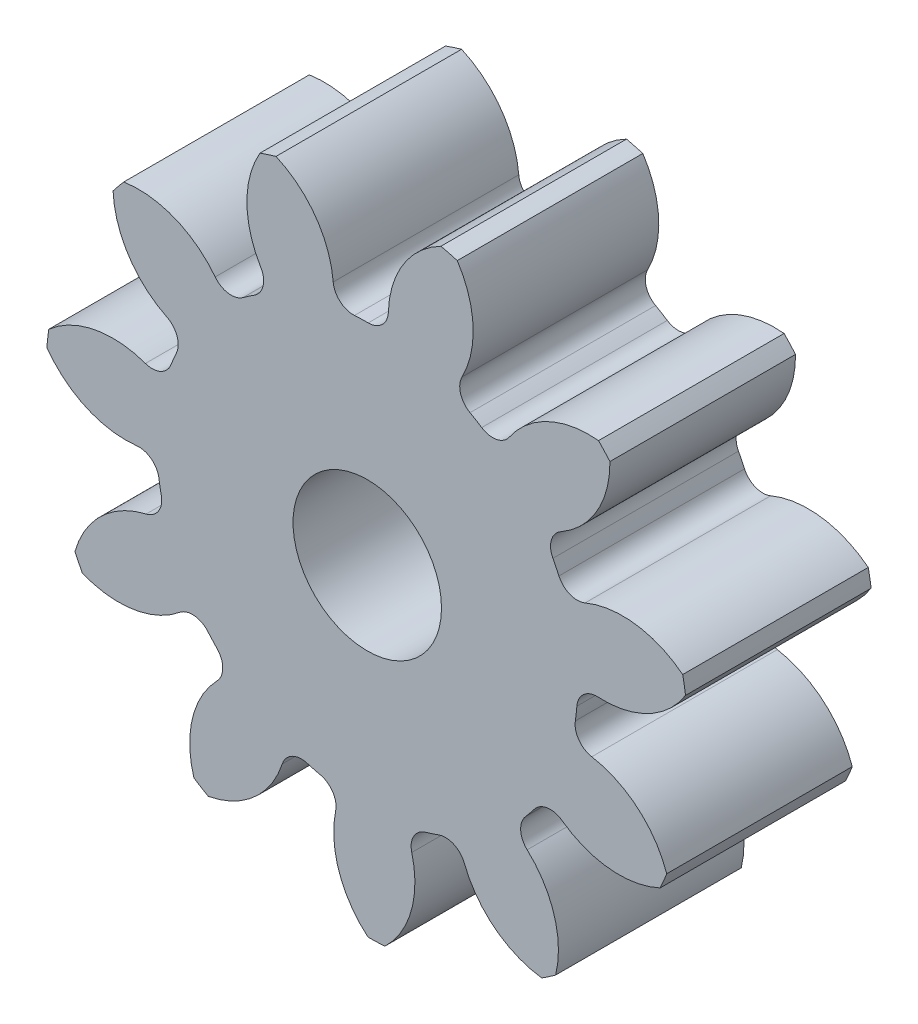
ISO-10303-21;
HEADER;
FILE_DESCRIPTION(('STEP AP214'),'2;1');
FILE_NAME('part.step','',(''),(''),'','','');
FILE_SCHEMA(('AUTOMOTIVE_DESIGN { 1 0 10303 214 1 1 1 1 }'));
ENDSEC;
DATA;
#1=APPLICATION_CONTEXT('core data for automotive mechanical design processes');
#2=APPLICATION_PROTOCOL_DEFINITION('international standard','automotive_design',2000,#1);
#3=PRODUCT_CONTEXT('',#1,'mechanical');
#4=PRODUCT('Part','Part','',(#3));
#5=PRODUCT_RELATED_PRODUCT_CATEGORY('part','',(#4));
#6=PRODUCT_DEFINITION_FORMATION('','',#4);
#7=PRODUCT_DEFINITION_CONTEXT('part definition',#1,'design');
#8=PRODUCT_DEFINITION('design','',#6,#7);
#9=PRODUCT_DEFINITION_SHAPE('','',#8);
#10=(LENGTH_UNIT() NAMED_UNIT(*) SI_UNIT(.MILLI.,.METRE.));
#11=(NAMED_UNIT(*) PLANE_ANGLE_UNIT() SI_UNIT($,.RADIAN.));
#12=(NAMED_UNIT(*) SI_UNIT($,.STERADIAN.) SOLID_ANGLE_UNIT());
#13=UNCERTAINTY_MEASURE_WITH_UNIT(LENGTH_MEASURE(1.E-05),#10,'distance_accuracy_value','');
#14=(GEOMETRIC_REPRESENTATION_CONTEXT(3) GLOBAL_UNCERTAINTY_ASSIGNED_CONTEXT((#13)) GLOBAL_UNIT_ASSIGNED_CONTEXT((#10,
#11,#12)) REPRESENTATION_CONTEXT('',''));
#15=CARTESIAN_POINT('',(0.,0.,0.));
#16=DIRECTION('',(0.,0.,1.));
#17=DIRECTION('',(1.,0.,0.));
#18=AXIS2_PLACEMENT_3D('',#15,#16,#17);
#19=CARTESIAN_POINT('',(0.,0.,127.));
#20=DIRECTION('',(0.,0.,-1.));
#21=DIRECTION('',(-1.,0.,0.));
#22=AXIS2_PLACEMENT_3D('',#19,#20,#21);
#23=CYLINDRICAL_SURFACE('',#22,220.133333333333);
#24=DIRECTION('',(0.,0.,-1.));
#25=VECTOR('',#24,1.);
#26=CARTESIAN_POINT('',(215.863028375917,43.1490141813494,63.5));
#27=LINE('',#26,#25);
#28=CARTESIAN_POINT('',(215.863028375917,43.1490141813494,127.));
#29=VERTEX_POINT('',#28);
#30=CARTESIAN_POINT('',(215.863028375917,43.1490141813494,0.));
#31=VERTEX_POINT('',#30);
#32=EDGE_CURVE('E492',#29,#31,#27,.T.);
#33=ORIENTED_EDGE('',*,*,#32,.F.);
#34=CARTESIAN_POINT('',(0.,0.,127.));
#35=DIRECTION('',(0.,0.,1.));
#36=DIRECTION('',(1.,0.,0.));
#37=AXIS2_PLACEMENT_3D('',#34,#35,#36);
#38=CIRCLE('',#37,220.133333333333);
#39=CARTESIAN_POINT('',(217.82789763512,31.7756425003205,127.));
#40=VERTEX_POINT('',#39);
#41=EDGE_CURVE('E871',#40,#29,#38,.T.);
#42=ORIENTED_EDGE('',*,*,#41,.F.);
#43=DIRECTION('',(0.,0.,-1.));
#44=VECTOR('',#43,1.);
#45=CARTESIAN_POINT('',(217.82789763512,31.7756425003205,63.5));
#46=LINE('',#45,#44);
#47=CARTESIAN_POINT('',(217.82789763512,31.7756425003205,0.));
#48=VERTEX_POINT('',#47);
#49=EDGE_CURVE('E865',#48,#40,#46,.F.);
#50=ORIENTED_EDGE('',*,*,#49,.F.);
#51=CARTESIAN_POINT('',(0.,0.,0.));
#52=DIRECTION('',(0.,0.,1.));
#53=DIRECTION('',(1.,0.,0.));
#54=AXIS2_PLACEMENT_3D('',#51,#52,#53);
#55=CIRCLE('',#54,220.133333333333);
#56=EDGE_CURVE('E876',#48,#31,#55,.T.);
#57=ORIENTED_EDGE('',*,*,#56,.T.);
#58=EDGE_LOOP('',(#33,#42,#50,#57));
#59=FACE_BOUND('',#58,.T.);
#60=ADVANCED_FACE('F33',(#59),#23,.T.);
#61=DIRECTION('',(0.,0.,-1.));
#62=VECTOR('',#61,1.);
#63=CARTESIAN_POINT('',(166.069279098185,144.498024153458,63.5));
#64=LINE('',#63,#62);
#65=CARTESIAN_POINT('',(166.069279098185,144.498024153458,0.));
#66=VERTEX_POINT('',#65);
#67=CARTESIAN_POINT('',(166.069279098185,144.498024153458,127.));
#68=VERTEX_POINT('',#67);
#69=EDGE_CURVE('E463',#66,#68,#64,.F.);
#70=ORIENTED_EDGE('',*,*,#69,.F.);
#71=CARTESIAN_POINT('',(158.26741692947,153.00362473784,0.));
#72=VERTEX_POINT('',#71);
#73=EDGE_CURVE('E879',#66,#72,#55,.T.);
#74=ORIENTED_EDGE('',*,*,#73,.T.);
#75=DIRECTION('',(0.,0.,-1.));
#76=VECTOR('',#75,1.);
#77=CARTESIAN_POINT('',(158.26741692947,153.00362473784,63.5));
#78=LINE('',#77,#76);
#79=CARTESIAN_POINT('',(158.26741692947,153.00362473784,127.));
#80=VERTEX_POINT('',#79);
#81=EDGE_CURVE('E525',#80,#72,#78,.T.);
#82=ORIENTED_EDGE('',*,*,#81,.F.);
#83=EDGE_CURVE('E874',#68,#80,#38,.T.);
#84=ORIENTED_EDGE('',*,*,#83,.F.);
#85=EDGE_LOOP('',(#70,#74,#82,#84));
#86=FACE_BOUND('',#85,.T.);
#87=ADVANCED_FACE('F1006',(#86),#23,.T.);
#88=CARTESIAN_POINT('',(0.,0.,127.));
#89=DIRECTION('',(0.,0.,1.));
#90=DIRECTION('',(1.,0.,0.));
#91=AXIS2_PLACEMENT_3D('',#88,#89,#90);
#92=PLANE('',#91);
#93=CARTESIAN_POINT('',(0.,0.,127.000000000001));
#94=DIRECTION('',(0.,0.,1.));
#95=DIRECTION('',(1.,0.,0.));
#96=AXIS2_PLACEMENT_3D('',#93,#94,#95);
#97=CIRCLE('',#96,50.8);
#98=CARTESIAN_POINT('',(50.8,0.,127.000000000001));
#99=VERTEX_POINT('',#98);
#100=EDGE_CURVE('E480',#99,#99,#97,.T.);
#101=ORIENTED_EDGE('',*,*,#100,.F.);
#102=EDGE_LOOP('',(#101));
#103=FACE_BOUND('',#102,.T.);
#104=ORIENTED_EDGE('',*,*,#41,.T.);
#105=CARTESIAN_POINT('',(174.809781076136,-8.84510114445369,127.));
#106=DIRECTION('',(0.,0.,-1.));
#107=DIRECTION('',(0.841253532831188,0.540640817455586,0.));
#108=AXIS2_PLACEMENT_3D('',#105,#106,#107);
#109=CIRCLE('',#108,66.2476953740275);
#110=CARTESIAN_POINT('',(149.091795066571,52.2068630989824,127.));
#111=VERTEX_POINT('',#110);
#112=EDGE_CURVE('E472',#111,#29,#109,.T.);
#113=ORIENTED_EDGE('',*,*,#112,.F.);
#114=CARTESIAN_POINT('',(143.740818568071,64.9095539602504,127.));
#115=DIRECTION('',(0.,0.,1.));
#116=DIRECTION('',(-0.841253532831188,-0.540640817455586,0.));
#117=AXIS2_PLACEMENT_3D('',#114,#115,#116);
#118=CIRCLE('',#117,13.7837333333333);
#119=CARTESIAN_POINT('',(131.178543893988,59.2367627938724,127.));
#120=VERTEX_POINT('',#119);
#121=EDGE_CURVE('E470',#120,#111,#118,.T.);
#122=ORIENTED_EDGE('',*,*,#121,.F.);
#123=CARTESIAN_POINT('',(0.,0.,127.));
#124=DIRECTION('',(0.,0.,-1.));
#125=DIRECTION('',(0.841253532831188,0.540640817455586,0.));
#126=AXIS2_PLACEMENT_3D('',#123,#124,#125);
#127=CIRCLE('',#126,143.933333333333);
#128=CARTESIAN_POINT('',(127.052565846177,67.6346801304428,127.));
#129=VERTEX_POINT('',#128);
#130=EDGE_CURVE('E455',#129,#120,#127,.T.);
#131=ORIENTED_EDGE('',*,*,#130,.F.);
#132=CARTESIAN_POINT('',(139.219717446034,74.1116953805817,127.));
#133=DIRECTION('',(0.,0.,1.));
#134=DIRECTION('',(-0.841253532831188,-0.540640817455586,0.));
#135=AXIS2_PLACEMENT_3D('',#132,#133,#134);
#136=CIRCLE('',#135,13.7837333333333);
#137=CARTESIAN_POINT('',(132.434893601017,86.1099231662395,127.));
#138=VERTEX_POINT('',#137);
#139=EDGE_CURVE('E447',#138,#129,#136,.T.);
#140=ORIENTED_EDGE('',*,*,#139,.F.);
#141=CARTESIAN_POINT('',(99.8255175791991,143.776080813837,127.));
#142=DIRECTION('',(0.,0.,-1.));
#143=DIRECTION('',(-0.841253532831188,-0.540640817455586,0.));
#144=AXIS2_PLACEMENT_3D('',#141,#142,#143);
#145=CIRCLE('',#144,66.2476953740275);
#146=EDGE_CURVE('E477',#68,#138,#145,.T.);
#147=ORIENTED_EDGE('',*,*,#146,.F.);
#148=ORIENTED_EDGE('',*,*,#83,.T.);
#149=CARTESIAN_POINT('',(151.841368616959,87.0683303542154,127.));
#150=DIRECTION('',(0.,0.,-1.));
#151=DIRECTION('',(0.415415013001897,0.909631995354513,0.));
#152=AXIS2_PLACEMENT_3D('',#149,#150,#151);
#153=CIRCLE('',#152,66.2476953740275);
#154=CARTESIAN_POINT('',(97.1988381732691,124.524317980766,127.));
#155=VERTEX_POINT('',#154);
#156=EDGE_CURVE('E501',#155,#80,#153,.T.);
#157=ORIENTED_EDGE('',*,*,#156,.F.);
#158=CARTESIAN_POINT('',(85.8297171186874,132.317545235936,127.));
#159=DIRECTION('',(0.,0.,1.));
#160=DIRECTION('',(-0.415415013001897,-0.909631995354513,0.));
#161=AXIS2_PLACEMENT_3D('',#158,#159,#160);
#162=CIRCLE('',#161,13.7837333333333);
#163=CARTESIAN_POINT('',(78.3286016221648,120.753611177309,127.));
#164=VERTEX_POINT('',#163);
#165=EDGE_CURVE('E499',#164,#155,#162,.T.);
#166=ORIENTED_EDGE('',*,*,#165,.F.);
#167=CARTESIAN_POINT('',(0.,0.,127.));
#168=DIRECTION('',(0.,0.,-1.));
#169=DIRECTION('',(0.415415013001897,0.909631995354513,0.));
#170=AXIS2_PLACEMENT_3D('',#167,#168,#169);
#171=CIRCLE('',#170,143.933333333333);
#172=CARTESIAN_POINT('',(70.317351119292,125.58771666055,127.));
#173=VERTEX_POINT('',#172);
#174=EDGE_CURVE('E496',#173,#164,#171,.T.);
#175=ORIENTED_EDGE('',*,*,#174,.F.);
#176=CARTESIAN_POINT('',(77.0512715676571,137.614587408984,127.));
#177=DIRECTION('',(0.,0.,1.));
#178=DIRECTION('',(-0.415415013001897,-0.909631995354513,0.));
#179=AXIS2_PLACEMENT_3D('',#176,#177,#178);
#180=CIRCLE('',#179,13.7837333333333);
#181=CARTESIAN_POINT('',(64.8567828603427,144.03998621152,127.));
#182=VERTEX_POINT('',#181);
#183=EDGE_CURVE('E494',#182,#173,#180,.T.);
#184=ORIENTED_EDGE('',*,*,#183,.F.);
#185=CARTESIAN_POINT('',(6.24735146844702,174.921885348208,127.));
#186=DIRECTION('',(0.,0.,-1.));
#187=DIRECTION('',(-0.415415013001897,-0.909631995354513,0.));
#188=AXIS2_PLACEMENT_3D('',#185,#186,#187);
#189=CIRCLE('',#188,66.2476953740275);
#190=CARTESIAN_POINT('',(61.584837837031,211.343304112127,127.));
#191=VERTEX_POINT('',#190);
#192=EDGE_CURVE('E504',#191,#182,#189,.T.);
#193=ORIENTED_EDGE('',*,*,#192,.F.);
#194=CARTESIAN_POINT('',(50.4230188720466,214.280665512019,127.));
#195=VERTEX_POINT('',#194);
#196=EDGE_CURVE('E909',#191,#195,#38,.T.);
#197=ORIENTED_EDGE('',*,*,#196,.T.);
#198=CARTESIAN_POINT('',(80.6643944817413,155.338182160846,127.));
#199=DIRECTION('',(0.,0.,-1.));
#200=DIRECTION('',(-0.142314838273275,0.989821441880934,0.));
#201=AXIS2_PLACEMENT_3D('',#198,#199,#200);
#202=CIRCLE('',#201,66.2476953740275);
#203=CARTESIAN_POINT('',(14.4459369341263,157.306181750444,127.));
#204=VERTEX_POINT('',#203);
#205=EDGE_CURVE('E536',#204,#195,#202,.T.);
#206=ORIENTED_EDGE('',*,*,#205,.F.);
#207=CARTESIAN_POINT('',(0.668286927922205,157.71565081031,127.));
#208=DIRECTION('',(0.,0.,1.));
#209=DIRECTION('',(0.142314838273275,-0.989821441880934,0.));
#210=AXIS2_PLACEMENT_3D('',#207,#208,#209);
#211=CIRCLE('',#210,13.7837333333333);
#212=CARTESIAN_POINT('',(0.609881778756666,143.932041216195,127.));
#213=VERTEX_POINT('',#212);
#214=EDGE_CURVE('E534',#213,#204,#211,.T.);
#215=ORIENTED_EDGE('',*,*,#214,.F.);
#216=CARTESIAN_POINT('',(0.,0.,127.));
#217=DIRECTION('',(0.,0.,-1.));
#218=DIRECTION('',(-0.142314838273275,0.989821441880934,0.));
#219=AXIS2_PLACEMENT_3D('',#216,#217,#218);
#220=CIRCLE('',#219,143.933333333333);
#221=CARTESIAN_POINT('',(-8.74312574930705,143.667540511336,127.));
#222=VERTEX_POINT('',#221);
#223=EDGE_CURVE('E531',#222,#213,#220,.T.);
#224=ORIENTED_EDGE('',*,*,#223,.F.);
#225=CARTESIAN_POINT('',(-9.58040861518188,157.425820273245,127.));
#226=DIRECTION('',(0.,0.,1.));
#227=DIRECTION('',(0.142314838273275,-0.989821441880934,0.));
#228=AXIS2_PLACEMENT_3D('',#225,#226,#227);
#229=CIRCLE('',#228,13.7837333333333);
#230=CARTESIAN_POINT('',(-23.3128981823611,156.238371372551,127.));
#231=VERTEX_POINT('',#230);
#232=EDGE_CURVE('E529',#231,#222,#229,.T.);
#233=ORIENTED_EDGE('',*,*,#232,.F.);
#234=CARTESIAN_POINT('',(-89.3143045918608,150.531227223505,127.));
#235=DIRECTION('',(0.,0.,-1.));
#236=DIRECTION('',(0.142314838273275,-0.989821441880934,0.));
#237=AXIS2_PLACEMENT_3D('',#234,#235,#236);
#238=CIRCLE('',#237,66.2476953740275);
#239=CARTESIAN_POINT('',(-62.4523542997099,211.088578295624,127.));
#240=VERTEX_POINT('',#239);
#241=EDGE_CURVE('E539',#240,#231,#238,.T.);
#242=ORIENTED_EDGE('',*,*,#241,.F.);
#243=CARTESIAN_POINT('',(-73.4303314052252,207.525109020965,127.));
#244=VERTEX_POINT('',#243);
#245=EDGE_CURVE('E988',#240,#244,#38,.T.);
#246=ORIENTED_EDGE('',*,*,#245,.T.);
#247=CARTESIAN_POINT('',(-16.1229549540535,174.289258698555,127.));
#248=DIRECTION('',(0.,0.,-1.));
#249=DIRECTION('',(-0.654860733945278,0.755749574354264,0.));
#250=AXIS2_PLACEMENT_3D('',#247,#248,#249);
#251=CIRCLE('',#250,66.2476953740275);
#252=CARTESIAN_POINT('',(-72.8934472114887,140.144444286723,127.));
#253=VERTEX_POINT('',#252);
#254=EDGE_CURVE('E574',#253,#244,#251,.T.);
#255=ORIENTED_EDGE('',*,*,#254,.F.);
#256=CARTESIAN_POINT('',(-84.7053196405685,133.040151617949,127.));
#257=DIRECTION('',(0.,0.,1.));
#258=DIRECTION('',(0.654860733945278,-0.755749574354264,0.));
#259=AXIS2_PLACEMENT_3D('',#256,#257,#258);
#260=CIRCLE('',#259,13.7837333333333);
#261=CARTESIAN_POINT('',(-77.302471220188,121.413065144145,127.));
#262=VERTEX_POINT('',#261);
#263=EDGE_CURVE('E572',#262,#253,#260,.T.);
#264=ORIENTED_EDGE('',*,*,#263,.F.);
#265=CARTESIAN_POINT('',(0.,0.,127.));
#266=DIRECTION('',(0.,0.,-1.));
#267=DIRECTION('',(-0.654860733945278,0.755749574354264,0.));
#268=AXIS2_PLACEMENT_3D('',#265,#266,#267);
#269=CIRCLE('',#268,143.933333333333);
#270=CARTESIAN_POINT('',(-85.0277219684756,116.133935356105,127.));
#271=VERTEX_POINT('',#270);
#272=EDGE_CURVE('E569',#271,#262,#269,.T.);
#273=ORIENTED_EDGE('',*,*,#272,.F.);
#274=CARTESIAN_POINT('',(-93.1703767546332,127.255467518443,127.));
#275=DIRECTION('',(0.,0.,1.));
#276=DIRECTION('',(0.654860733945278,-0.755749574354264,0.));
#277=AXIS2_PLACEMENT_3D('',#274,#275,#276);
#278=CIRCLE('',#277,13.7837333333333);
#279=CARTESIAN_POINT('',(-104.080898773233,118.832177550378,127.));
#280=VERTEX_POINT('',#279);
#281=EDGE_CURVE('E567',#280,#271,#278,.T.);
#282=ORIENTED_EDGE('',*,*,#281,.F.);
#283=CARTESIAN_POINT('',(-156.519300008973,78.3479680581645,127.));
#284=DIRECTION('',(0.,0.,-1.));
#285=DIRECTION('',(0.654860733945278,-0.755749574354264,0.));
#286=AXIS2_PLACEMENT_3D('',#283,#284,#285);
#287=CIRCLE('',#286,66.2476953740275);
#288=CARTESIAN_POINT('',(-166.661365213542,143.814720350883,127.));
#289=VERTEX_POINT('',#288);
#290=EDGE_CURVE('E577',#289,#280,#287,.T.);
#291=ORIENTED_EDGE('',*,*,#290,.F.);
#292=CARTESIAN_POINT('',(-173.970070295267,134.881796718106,127.));
#293=VERTEX_POINT('',#292);
#294=EDGE_CURVE('E984',#289,#293,#38,.T.);
#295=ORIENTED_EDGE('',*,*,#294,.T.);
#296=CARTESIAN_POINT('',(-107.791380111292,137.904727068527,127.));
#297=DIRECTION('',(0.,0.,-1.));
#298=DIRECTION('',(-0.959492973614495,0.281732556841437,0.));
#299=AXIS2_PLACEMENT_3D('',#296,#297,#298);
#300=CIRCLE('',#299,66.2476953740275);
#301=CARTESIAN_POINT('',(-137.089676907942,78.4878359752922,127.));
#302=VERTEX_POINT('',#301);
#303=EDGE_CURVE('E612',#302,#293,#300,.T.);
#304=ORIENTED_EDGE('',*,*,#303,.F.);
#305=CARTESIAN_POINT('',(-143.185585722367,66.1253443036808,127.));
#306=DIRECTION('',(0.,0.,1.));
#307=DIRECTION('',(0.959492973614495,-0.281732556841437,0.));
#308=AXIS2_PLACEMENT_3D('',#305,#306,#307);
#309=CIRCLE('',#308,13.7837333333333);
#310=CARTESIAN_POINT('',(-130.671835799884,60.346298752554,127.));
#311=VERTEX_POINT('',#310);
#312=EDGE_CURVE('E610',#311,#302,#309,.T.);
#313=ORIENTED_EDGE('',*,*,#312,.F.);
#314=CARTESIAN_POINT('',(0.,0.,127.));
#315=DIRECTION('',(0.,0.,-1.));
#316=DIRECTION('',(-0.959492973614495,0.281732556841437,0.));
#317=AXIS2_PLACEMENT_3D('',#314,#315,#316);
#318=CIRCLE('',#317,143.933333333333);
#319=CARTESIAN_POINT('',(-134.316617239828,51.7286262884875,127.));
#320=VERTEX_POINT('',#319);
#321=EDGE_CURVE('E607',#320,#311,#318,.T.);
#322=ORIENTED_EDGE('',*,*,#321,.F.);
#323=CARTESIAN_POINT('',(-147.179408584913,56.6824029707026,127.));
#324=DIRECTION('',(0.,0.,1.));
#325=DIRECTION('',(0.959492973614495,-0.281732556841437,0.));
#326=AXIS2_PLACEMENT_3D('',#323,#324,#325);
#327=CIRCLE('',#326,13.7837333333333);
#328=CARTESIAN_POINT('',(-151.803949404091,43.6976069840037,127.));
#329=VERTEX_POINT('',#328);
#330=EDGE_CURVE('E605',#329,#320,#327,.T.);
#331=ORIENTED_EDGE('',*,*,#330,.F.);
#332=CARTESIAN_POINT('',(-174.030523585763,-18.710217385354,127.));
#333=DIRECTION('',(0.,0.,-1.));
#334=DIRECTION('',(0.959492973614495,-0.281732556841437,0.));
#335=AXIS2_PLACEMENT_3D('',#332,#333,#334);
#336=CIRCLE('',#335,66.2476953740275);
#337=CARTESIAN_POINT('',(-217.95657024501,30.8807048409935,127.));
#338=VERTEX_POINT('',#337);
#339=EDGE_CURVE('E615',#338,#329,#336,.T.);
#340=ORIENTED_EDGE('',*,*,#339,.F.);
#341=CARTESIAN_POINT('',(-219.275541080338,19.4144669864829,127.));
#342=VERTEX_POINT('',#341);
#343=EDGE_CURVE('E980',#338,#342,#38,.T.);
#344=ORIENTED_EDGE('',*,*,#343,.T.);
#345=CARTESIAN_POINT('',(-165.236803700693,57.7364189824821,127.));
#346=DIRECTION('',(0.,0.,-1.));
#347=DIRECTION('',(-0.959492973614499,-0.281732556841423,0.));
#348=AXIS2_PLACEMENT_3D('',#345,#346,#347);
#349=CIRCLE('',#348,66.2476953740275);
#350=CARTESIAN_POINT('',(-157.760902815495,-8.08810568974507,127.));
#351=VERTEX_POINT('',#350);
#352=EDGE_CURVE('E650',#351,#342,#349,.T.);
#353=ORIENTED_EDGE('',*,*,#352,.F.);
#354=CARTESIAN_POINT('',(-156.205440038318,-21.7837926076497,127.));
#355=DIRECTION('',(0.,0.,1.));
#356=DIRECTION('',(0.959492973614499,0.281732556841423,0.));
#357=AXIS2_PLACEMENT_3D('',#354,#355,#356);
#358=CIRCLE('',#357,13.7837333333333);
#359=CARTESIAN_POINT('',(-142.553815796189,-19.8799911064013,127.));
#360=VERTEX_POINT('',#359);
#361=EDGE_CURVE('E648',#360,#351,#358,.T.);
#362=ORIENTED_EDGE('',*,*,#361,.F.);
#363=CARTESIAN_POINT('',(0.,0.,127.));
#364=DIRECTION('',(0.,0.,-1.));
#365=DIRECTION('',(-0.959492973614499,-0.281732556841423,0.));
#366=AXIS2_PLACEMENT_3D('',#363,#364,#365);
#367=CIRCLE('',#366,143.933333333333);
#368=CARTESIAN_POINT('',(-140.960935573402,-29.1001561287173,127.));
#369=VERTEX_POINT('',#368);
#370=EDGE_CURVE('E645',#369,#360,#367,.T.);
#371=ORIENTED_EDGE('',*,*,#370,.F.);
#372=CARTESIAN_POINT('',(-154.46001810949,-31.8869240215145,127.));
#373=DIRECTION('',(0.,0.,1.));
#374=DIRECTION('',(0.959492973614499,0.281732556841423,0.));
#375=AXIS2_PLACEMENT_3D('',#372,#373,#374);
#376=CIRCLE('',#375,13.7837333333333);
#377=CARTESIAN_POINT('',(-151.330318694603,-45.3106450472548,127.));
#378=VERTEX_POINT('',#377);
#379=EDGE_CURVE('E643',#378,#369,#376,.T.);
#380=ORIENTED_EDGE('',*,*,#379,.F.);
#381=CARTESIAN_POINT('',(-136.288285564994,-109.828041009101,127.));
#382=DIRECTION('',(0.,0.,-1.));
#383=DIRECTION('',(0.959492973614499,0.281732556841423,0.));
#384=AXIS2_PLACEMENT_3D('',#381,#382,#383);
#385=CIRCLE('',#384,66.2476953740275);
#386=CARTESIAN_POINT('',(-200.052104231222,-91.857716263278,127.));
#387=VERTEX_POINT('',#386);
#388=EDGE_CURVE('E653',#387,#378,#385,.T.);
#389=ORIENTED_EDGE('',*,*,#388,.F.);
#390=CARTESIAN_POINT('',(-194.96257689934,-102.21681883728,127.));
#391=VERTEX_POINT('',#390);
#392=EDGE_CURVE('E976',#387,#391,#38,.T.);
#393=ORIENTED_EDGE('',*,*,#392,.T.);
#394=CARTESIAN_POINT('',(-170.220709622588,-40.7627941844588,127.));
#395=DIRECTION('',(0.,0.,-1.));
#396=DIRECTION('',(-0.654860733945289,-0.755749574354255,0.));
#397=AXIS2_PLACEMENT_3D('',#394,#395,#396);
#398=CIRCLE('',#397,66.2476953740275);
#399=CARTESIAN_POINT('',(-128.3441567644,-92.0961309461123,127.));
#400=VERTEX_POINT('',#399);
#401=EDGE_CURVE('E688',#400,#391,#398,.T.);
#402=ORIENTED_EDGE('',*,*,#401,.F.);
#403=CARTESIAN_POINT('',(-119.631170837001,-102.776729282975,127.));
#404=DIRECTION('',(0.,0.,1.));
#405=DIRECTION('',(0.654860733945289,0.755749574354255,0.));
#406=AXIS2_PLACEMENT_3D('',#403,#404,#405);
#407=CIRCLE('',#406,13.7837333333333);
#408=CARTESIAN_POINT('',(-109.175966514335,-93.7945242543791,127.));
#409=VERTEX_POINT('',#408);
#410=EDGE_CURVE('E686',#409,#400,#407,.T.);
#411=ORIENTED_EDGE('',*,*,#410,.F.);
#412=CARTESIAN_POINT('',(0.,0.,127.));
#413=DIRECTION('',(0.,0.,-1.));
#414=DIRECTION('',(-0.654860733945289,-0.755749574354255,0.));
#415=AXIS2_PLACEMENT_3D('',#412,#413,#414);
#416=CIRCLE('',#415,143.933333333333);
#417=CARTESIAN_POINT('',(-102.851152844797,-100.689844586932,127.));
#418=VERTEX_POINT('',#417);
#419=EDGE_CURVE('E683',#418,#409,#416,.T.);
#420=ORIENTED_EDGE('',*,*,#419,.F.);
#421=CARTESIAN_POINT('',(-112.70066324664,-110.33237793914,127.));
#422=DIRECTION('',(0.,0.,1.));
#423=DIRECTION('',(0.654860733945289,0.755749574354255,0.));
#424=AXIS2_PLACEMENT_3D('',#421,#422,#423);
#425=CIRCLE('',#424,13.7837333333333);
#426=CARTESIAN_POINT('',(-102.810381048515,-119.933087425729,127.));
#427=VERTEX_POINT('',#426);
#428=EDGE_CURVE('E681',#427,#418,#425,.T.);
#429=ORIENTED_EDGE('',*,*,#428,.F.);
#430=CARTESIAN_POINT('',(-55.2754798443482,-166.076237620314,127.));
#431=DIRECTION('',(0.,0.,-1.));
#432=DIRECTION('',(0.654860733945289,0.755749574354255,0.));
#433=AXIS2_PLACEMENT_3D('',#430,#431,#432);
#434=CIRCLE('',#433,66.2476953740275);
#435=CARTESIAN_POINT('',(-118.632508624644,-185.431961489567,127.));
#436=VERTEX_POINT('',#435);
#437=EDGE_CURVE('E691',#436,#427,#434,.T.);
#438=ORIENTED_EDGE('',*,*,#437,.F.);
#439=CARTESIAN_POINT('',(-108.750372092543,-191.394986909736,127.));
#440=VERTEX_POINT('',#439);
#441=EDGE_CURVE('E972',#436,#440,#38,.T.);
#442=ORIENTED_EDGE('',*,*,#441,.T.);
#443=CARTESIAN_POINT('',(-121.160742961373,-126.320108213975,127.));
#444=DIRECTION('',(0.,0.,-1.));
#445=DIRECTION('',(-0.142314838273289,-0.989821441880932,0.));
#446=AXIS2_PLACEMENT_3D('',#443,#444,#445);
#447=CIRCLE('',#446,66.2476953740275);
#448=CARTESIAN_POINT('',(-58.1790477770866,-146.864285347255,127.));
#449=VERTEX_POINT('',#448);
#450=EDGE_CURVE('E726',#449,#440,#447,.T.);
#451=ORIENTED_EDGE('',*,*,#450,.F.);
#452=CARTESIAN_POINT('',(-45.0748501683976,-151.138780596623,127.));
#453=DIRECTION('',(0.,0.,1.));
#454=DIRECTION('',(0.142314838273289,0.989821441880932,0.));
#455=AXIS2_PLACEMENT_3D('',#452,#453,#454);
#456=CIRCLE('',#455,13.7837333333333);
#457=CARTESIAN_POINT('',(-41.1355192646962,-137.929958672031,127.));
#458=VERTEX_POINT('',#457);
#459=EDGE_CURVE('E724',#458,#449,#456,.T.);
#460=ORIENTED_EDGE('',*,*,#459,.F.);
#461=CARTESIAN_POINT('',(0.,0.,127.));
#462=DIRECTION('',(0.,0.,-1.));
#463=DIRECTION('',(-0.142314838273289,-0.989821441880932,0.));
#464=AXIS2_PLACEMENT_3D('',#461,#462,#463);
#465=CIRCLE('',#464,143.933333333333);
#466=CARTESIAN_POINT('',(-32.0868557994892,-140.311218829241,127.));
#467=VERTEX_POINT('',#466);
#468=EDGE_CURVE('E721',#467,#458,#465,.T.);
#469=ORIENTED_EDGE('',*,*,#468,.F.);
#470=CARTESIAN_POINT('',(-35.1596441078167,-153.748081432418,127.));
#471=DIRECTION('',(0.,0.,1.));
#472=DIRECTION('',(0.142314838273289,0.989821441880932,0.));
#473=AXIS2_PLACEMENT_3D('',#470,#471,#472);
#474=CIRCLE('',#473,13.7837333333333);
#475=CARTESIAN_POINT('',(-21.648873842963,-156.477621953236,127.));
#476=VERTEX_POINT('',#475);
#477=EDGE_CURVE('E719',#476,#467,#474,.T.);
#478=ORIENTED_EDGE('',*,*,#477,.F.);
#479=CARTESIAN_POINT('',(43.2869001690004,-169.596402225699,127.));
#480=DIRECTION('',(0.,0.,-1.));
#481=DIRECTION('',(0.142314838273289,0.989821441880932,0.));
#482=AXIS2_PLACEMENT_3D('',#479,#480,#481);
#483=CIRCLE('',#482,66.2476953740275);
#484=CARTESIAN_POINT('',(0.452070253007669,-220.132869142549,127.));
#485=VERTEX_POINT('',#484);
#486=EDGE_CURVE('E729',#485,#476,#483,.T.);
#487=ORIENTED_EDGE('',*,*,#486,.F.);
#488=CARTESIAN_POINT('',(11.9893074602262,-219.806598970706,127.));
#489=VERTEX_POINT('',#488);
#490=EDGE_CURVE('E968',#485,#489,#38,.T.);
#491=ORIENTED_EDGE('',*,*,#490,.T.);
#492=CARTESIAN_POINT('',(-33.6330964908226,-171.771680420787,127.));
#493=DIRECTION('',(0.,0.,-1.));
#494=DIRECTION('',(0.415415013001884,-0.909631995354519,0.));
#495=AXIS2_PLACEMENT_3D('',#492,#493,#494);
#496=CIRCLE('',#495,66.2476953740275);
#497=CARTESIAN_POINT('',(30.457497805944,-155.004066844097,127.));
#498=VERTEX_POINT('',#497);
#499=EDGE_CURVE('E764',#498,#489,#496,.T.);
#500=ORIENTED_EDGE('',*,*,#499,.F.);
#501=CARTESIAN_POINT('',(43.7924169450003,-151.515336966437,127.));
#502=DIRECTION('',(0.,0.,1.));
#503=DIRECTION('',(-0.415415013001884,0.909631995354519,0.));
#504=AXIS2_PLACEMENT_3D('',#501,#502,#503);
#505=CIRCLE('',#504,13.7837333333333);
#506=CARTESIAN_POINT('',(39.9651647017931,-138.273605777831,127.));
#507=VERTEX_POINT('',#506);
#508=EDGE_CURVE('E762',#507,#498,#505,.T.);
#509=ORIENTED_EDGE('',*,*,#508,.F.);
#510=CARTESIAN_POINT('',(0.,0.,127.));
#511=DIRECTION('',(0.,0.,-1.));
#512=DIRECTION('',(0.415415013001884,-0.909631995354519,0.));
#513=AXIS2_PLACEMENT_3D('',#510,#511,#512);
#514=CIRCLE('',#513,143.933333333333);
#515=CARTESIAN_POINT('',(48.8647912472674,-135.384772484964,127.));
#516=VERTEX_POINT('',#515);
#517=EDGE_CURVE('E759',#516,#507,#514,.T.);
#518=ORIENTED_EDGE('',*,*,#517,.F.);
#519=CARTESIAN_POINT('',(53.5443136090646,-148.349855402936,127.));
#520=DIRECTION('',(0.,0.,1.));
#521=DIRECTION('',(-0.415415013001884,0.909631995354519,0.));
#522=AXIS2_PLACEMENT_3D('',#519,#520,#521);
#523=CIRCLE('',#522,13.7837333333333);
#524=CARTESIAN_POINT('',(66.3859978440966,-143.341617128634,127.));
#525=VERTEX_POINT('',#524);
#526=EDGE_CURVE('E757',#525,#516,#523,.T.);
#527=ORIENTED_EDGE('',*,*,#526,.F.);
#528=CARTESIAN_POINT('',(128.105995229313,-119.27090743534,127.));
#529=DIRECTION('',(0.,0.,-1.));
#530=DIRECTION('',(-0.415415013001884,0.909631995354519,0.));
#531=AXIS2_PLACEMENT_3D('',#528,#529,#530);
#532=CIRCLE('',#531,66.2476953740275);
#533=CARTESIAN_POINT('',(119.393120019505,-184.9431462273,127.));
#534=VERTEX_POINT('',#533);
#535=EDGE_CURVE('E767',#534,#525,#532,.T.);
#536=ORIENTED_EDGE('',*,*,#535,.F.);
#537=CARTESIAN_POINT('',(128.922466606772,-178.431168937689,127.));
#538=VERTEX_POINT('',#537);
#539=EDGE_CURVE('E967',#534,#538,#38,.T.);
#540=ORIENTED_EDGE('',*,*,#539,.T.);
#541=CARTESIAN_POINT('',(64.5728204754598,-162.686957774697,127.));
#542=DIRECTION('',(0.,0.,-1.));
#543=DIRECTION('',(0.841253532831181,-0.540640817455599,0.));
#544=AXIS2_PLACEMENT_3D('',#541,#542,#543);
#545=CIRCLE('',#544,66.2476953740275);
#546=CARTESIAN_POINT('',(109.424003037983,-113.931152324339,127.));
#547=VERTEX_POINT('',#546);
#548=EDGE_CURVE('E802',#547,#538,#545,.T.);
#549=ORIENTED_EDGE('',*,*,#548,.F.);
#550=CARTESIAN_POINT('',(118.755901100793,-103.786844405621,127.));
#551=DIRECTION('',(0.,0.,1.));
#552=DIRECTION('',(-0.841253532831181,0.540640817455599,0.));
#553=AXIS2_PLACEMENT_3D('',#550,#551,#552);
#554=CIRCLE('',#553,13.7837333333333);
#555=CARTESIAN_POINT('',(108.377191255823,-94.7163600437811,127.));
#556=VERTEX_POINT('',#555);
#557=EDGE_CURVE('E800',#556,#547,#554,.T.);
#558=ORIENTED_EDGE('',*,*,#557,.F.);
#559=CARTESIAN_POINT('',(0.,0.,127.));
#560=DIRECTION('',(0.,0.,-1.));
#561=DIRECTION('',(0.841253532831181,-0.540640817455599,0.));
#562=AXIS2_PLACEMENT_3D('',#559,#560,#561);
#563=CIRCLE('',#562,143.933333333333);
#564=CARTESIAN_POINT('',(114.302212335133,-87.4746174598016,127.));
#565=VERTEX_POINT('',#564);
#566=EDGE_CURVE('E797',#565,#556,#563,.T.);
#567=ORIENTED_EDGE('',*,*,#566,.F.);
#568=CARTESIAN_POINT('',(125.248330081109,-95.8515984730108,127.));
#569=DIRECTION('',(0.,0.,1.));
#570=DIRECTION('',(-0.841253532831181,0.540640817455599,0.));
#571=AXIS2_PLACEMENT_3D('',#568,#569,#570);
#572=CIRCLE('',#571,13.7837333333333);
#573=CARTESIAN_POINT('',(133.343784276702,-84.6956616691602,127.));
#574=VERTEX_POINT('',#573);
#575=EDGE_CURVE('E795',#574,#565,#572,.T.);
#576=ORIENTED_EDGE('',*,*,#575,.F.);
#577=CARTESIAN_POINT('',(172.252341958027,-31.0777422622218,127.));
#578=DIRECTION('',(0.,0.,-1.));
#579=DIRECTION('',(-0.841253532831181,0.540640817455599,0.));
#580=AXIS2_PLACEMENT_3D('',#577,#578,#579);
#581=CIRCLE('',#580,66.2476953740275);
#582=CARTESIAN_POINT('',(200.427697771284,-91.0352811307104,127.));
#583=VERTEX_POINT('',#582);
#584=EDGE_CURVE('E805',#583,#574,#581,.T.);
#585=ORIENTED_EDGE('',*,*,#584,.F.);
#586=CARTESIAN_POINT('',(204.923653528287,-80.4051035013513,127.));
#587=VERTEX_POINT('',#586);
#588=EDGE_CURVE('E875',#583,#587,#38,.T.);
#589=ORIENTED_EDGE('',*,*,#588,.T.);
#590=CARTESIAN_POINT('',(142.277323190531,-101.950275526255,127.));
#591=DIRECTION('',(0.,0.,-1.));
#592=DIRECTION('',(1.,0.,0.));
#593=AXIS2_PLACEMENT_3D('',#590,#591,#592);
#594=CIRCLE('',#593,66.2476953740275);
#595=CARTESIAN_POINT('',(153.649160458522,-36.6859019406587,127.));
#596=VERTEX_POINT('',#595);
#597=EDGE_CURVE('E840',#596,#587,#594,.T.);
#598=ORIENTED_EDGE('',*,*,#597,.F.);
#599=CARTESIAN_POINT('',(156.015225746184,-23.1067620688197,127.));
#600=DIRECTION('',(0.,0.,1.));
#601=DIRECTION('',(-1.,0.,0.));
#602=AXIS2_PLACEMENT_3D('',#599,#600,#601);
#603=CIRCLE('',#602,13.7837333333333);
#604=CARTESIAN_POINT('',(142.38022534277,-21.0873392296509,127.));
#605=VERTEX_POINT('',#604);
#606=EDGE_CURVE('E838',#605,#596,#603,.T.);
#607=ORIENTED_EDGE('',*,*,#606,.F.);
#608=CARTESIAN_POINT('',(0.,0.,127.));
#609=DIRECTION('',(0.,0.,-1.));
#610=DIRECTION('',(1.,0.,0.));
#611=AXIS2_PLACEMENT_3D('',#608,#609,#610);
#612=CIRCLE('',#611,143.933333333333);
#613=CARTESIAN_POINT('',(143.449488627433,-11.7918894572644,127.));
#614=VERTEX_POINT('',#613);
#615=EDGE_CURVE('E835',#614,#605,#612,.T.);
#616=ORIENTED_EDGE('',*,*,#615,.F.);
#617=CARTESIAN_POINT('',(157.186886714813,-12.9211362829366,127.));
#618=DIRECTION('',(0.,0.,1.));
#619=DIRECTION('',(-1.,0.,0.));
#620=AXIS2_PLACEMENT_3D('',#617,#618,#619);
#621=CIRCLE('',#620,13.7837333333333);
#622=CARTESIAN_POINT('',(157.965861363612,0.840567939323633,127.));
#623=VERTEX_POINT('',#622);
#624=EDGE_CURVE('E833',#623,#614,#621,.T.);
#625=ORIENTED_EDGE('',*,*,#624,.F.);
#626=CARTESIAN_POINT('',(161.709787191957,66.982386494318,127.));
#627=DIRECTION('',(0.,0.,-1.));
#628=DIRECTION('',(-1.,0.,0.));
#629=AXIS2_PLACEMENT_3D('',#626,#627,#628);
#630=CIRCLE('',#629,66.2476953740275);
#631=EDGE_CURVE('E843',#40,#623,#630,.T.);
#632=ORIENTED_EDGE('',*,*,#631,.F.);
#633=EDGE_LOOP('',(#104,#113,#122,#131,#140,#147,#148,#157,#166,#175,#184,#193,#197,#206,#215,
#224,#233,#242,#246,#255,#264,#273,#282,#291,#295,#304,#313,#322,#331,#340,#344,#353,#362,#371,
#380,#389,#393,#402,#411,#420,#429,#438,#442,#451,#460,#469,#478,#487,#491,#500,#509,#518,#527,
#536,#540,#549,#558,#567,#576,#585,#589,#598,#607,#616,#625,#632));
#634=FACE_BOUND('',#633,.T.);
#635=ADVANCED_FACE('F468',(#103,#634),#92,.T.);
#636=CARTESIAN_POINT('',(0.,0.,0.));
#637=DIRECTION('',(0.,0.,1.));
#638=DIRECTION('',(1.,0.,0.));
#639=AXIS2_PLACEMENT_3D('',#636,#637,#638);
#640=PLANE('',#639);
#641=CARTESIAN_POINT('',(0.,0.,0.));
#642=DIRECTION('',(0.,0.,1.));
#643=DIRECTION('',(1.,0.,0.));
#644=AXIS2_PLACEMENT_3D('',#641,#642,#643);
#645=CIRCLE('',#644,50.8);
#646=CARTESIAN_POINT('',(50.8,0.,-1.77635683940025E-12));
#647=VERTEX_POINT('',#646);
#648=EDGE_CURVE('E36',#647,#647,#645,.T.);
#649=ORIENTED_EDGE('',*,*,#648,.T.);
#650=EDGE_LOOP('',(#649));
#651=FACE_BOUND('',#650,.T.);
#652=CARTESIAN_POINT('',(174.809781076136,-8.84510114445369,0.));
#653=DIRECTION('',(0.,0.,-1.));
#654=DIRECTION('',(0.841253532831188,0.540640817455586,0.));
#655=AXIS2_PLACEMENT_3D('',#652,#653,#654);
#656=CIRCLE('',#655,66.2476953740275);
#657=CARTESIAN_POINT('',(149.091795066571,52.2068630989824,0.));
#658=VERTEX_POINT('',#657);
#659=EDGE_CURVE('E456',#658,#31,#656,.T.);
#660=ORIENTED_EDGE('',*,*,#659,.T.);
#661=ORIENTED_EDGE('',*,*,#56,.F.);
#662=CARTESIAN_POINT('',(161.709787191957,66.982386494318,0.));
#663=DIRECTION('',(0.,0.,1.));
#664=DIRECTION('',(1.,0.,0.));
#665=AXIS2_PLACEMENT_3D('',#662,#663,#664);
#666=CIRCLE('',#665,66.2476953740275);
#667=CARTESIAN_POINT('',(157.965861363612,0.840567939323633,0.));
#668=VERTEX_POINT('',#667);
#669=EDGE_CURVE('E873',#668,#48,#666,.T.);
#670=ORIENTED_EDGE('',*,*,#669,.F.);
#671=CARTESIAN_POINT('',(157.186886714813,-12.9211362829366,0.));
#672=DIRECTION('',(0.,0.,1.));
#673=DIRECTION('',(-1.,0.,0.));
#674=AXIS2_PLACEMENT_3D('',#671,#672,#673);
#675=CIRCLE('',#674,13.7837333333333);
#676=CARTESIAN_POINT('',(143.449488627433,-11.7918894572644,0.));
#677=VERTEX_POINT('',#676);
#678=EDGE_CURVE('E832',#668,#677,#675,.T.);
#679=ORIENTED_EDGE('',*,*,#678,.T.);
#680=CARTESIAN_POINT('',(0.,0.,0.));
#681=DIRECTION('',(0.,0.,-1.));
#682=DIRECTION('',(1.,0.,0.));
#683=AXIS2_PLACEMENT_3D('',#680,#681,#682);
#684=CIRCLE('',#683,143.933333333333);
#685=CARTESIAN_POINT('',(142.38022534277,-21.0873392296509,0.));
#686=VERTEX_POINT('',#685);
#687=EDGE_CURVE('E848',#677,#686,#684,.T.);
#688=ORIENTED_EDGE('',*,*,#687,.T.);
#689=CARTESIAN_POINT('',(156.015225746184,-23.1067620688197,0.));
#690=DIRECTION('',(0.,0.,1.));
#691=DIRECTION('',(-1.,0.,0.));
#692=AXIS2_PLACEMENT_3D('',#689,#690,#691);
#693=CIRCLE('',#692,13.7837333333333);
#694=CARTESIAN_POINT('',(153.649160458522,-36.6859019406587,0.));
#695=VERTEX_POINT('',#694);
#696=EDGE_CURVE('E851',#686,#695,#693,.T.);
#697=ORIENTED_EDGE('',*,*,#696,.T.);
#698=CARTESIAN_POINT('',(142.277323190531,-101.950275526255,0.));
#699=DIRECTION('',(0.,0.,-1.));
#700=DIRECTION('',(1.,0.,0.));
#701=AXIS2_PLACEMENT_3D('',#698,#699,#700);
#702=CIRCLE('',#701,66.2476953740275);
#703=CARTESIAN_POINT('',(204.923653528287,-80.4051035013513,0.));
#704=VERTEX_POINT('',#703);
#705=EDGE_CURVE('E836',#695,#704,#702,.T.);
#706=ORIENTED_EDGE('',*,*,#705,.T.);
#707=CARTESIAN_POINT('',(200.427697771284,-91.0352811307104,0.));
#708=VERTEX_POINT('',#707);
#709=EDGE_CURVE('E870',#708,#704,#55,.T.);
#710=ORIENTED_EDGE('',*,*,#709,.F.);
#711=CARTESIAN_POINT('',(172.252341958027,-31.0777422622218,0.));
#712=DIRECTION('',(0.,0.,1.));
#713=DIRECTION('',(1.,0.,0.));
#714=AXIS2_PLACEMENT_3D('',#711,#712,#713);
#715=CIRCLE('',#714,66.2476953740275);
#716=CARTESIAN_POINT('',(133.343784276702,-84.6956616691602,0.));
#717=VERTEX_POINT('',#716);
#718=EDGE_CURVE('E881',#717,#708,#715,.T.);
#719=ORIENTED_EDGE('',*,*,#718,.F.);
#720=CARTESIAN_POINT('',(125.248330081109,-95.8515984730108,0.));
#721=DIRECTION('',(0.,0.,1.));
#722=DIRECTION('',(-0.841253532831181,0.540640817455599,0.));
#723=AXIS2_PLACEMENT_3D('',#720,#721,#722);
#724=CIRCLE('',#723,13.7837333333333);
#725=CARTESIAN_POINT('',(114.302212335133,-87.4746174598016,0.));
#726=VERTEX_POINT('',#725);
#727=EDGE_CURVE('E794',#717,#726,#724,.T.);
#728=ORIENTED_EDGE('',*,*,#727,.T.);
#729=CARTESIAN_POINT('',(0.,0.,0.));
#730=DIRECTION('',(0.,0.,-1.));
#731=DIRECTION('',(0.841253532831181,-0.540640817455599,0.));
#732=AXIS2_PLACEMENT_3D('',#729,#730,#731);
#733=CIRCLE('',#732,143.933333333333);
#734=CARTESIAN_POINT('',(108.377191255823,-94.7163600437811,0.));
#735=VERTEX_POINT('',#734);
#736=EDGE_CURVE('E810',#726,#735,#733,.T.);
#737=ORIENTED_EDGE('',*,*,#736,.T.);
#738=CARTESIAN_POINT('',(118.755901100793,-103.786844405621,0.));
#739=DIRECTION('',(0.,0.,1.));
#740=DIRECTION('',(-0.841253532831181,0.540640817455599,0.));
#741=AXIS2_PLACEMENT_3D('',#738,#739,#740);
#742=CIRCLE('',#741,13.7837333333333);
#743=CARTESIAN_POINT('',(109.424003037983,-113.931152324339,0.));
#744=VERTEX_POINT('',#743);
#745=EDGE_CURVE('E813',#735,#744,#742,.T.);
#746=ORIENTED_EDGE('',*,*,#745,.T.);
#747=CARTESIAN_POINT('',(64.5728204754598,-162.686957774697,0.));
#748=DIRECTION('',(0.,0.,-1.));
#749=DIRECTION('',(0.841253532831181,-0.540640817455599,0.));
#750=AXIS2_PLACEMENT_3D('',#747,#748,#749);
#751=CIRCLE('',#750,66.2476953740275);
#752=CARTESIAN_POINT('',(128.922466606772,-178.431168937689,0.));
#753=VERTEX_POINT('',#752);
#754=EDGE_CURVE('E798',#744,#753,#751,.T.);
#755=ORIENTED_EDGE('',*,*,#754,.T.);
#756=CARTESIAN_POINT('',(119.393120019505,-184.9431462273,0.));
#757=VERTEX_POINT('',#756);
#758=EDGE_CURVE('E938',#757,#753,#55,.T.);
#759=ORIENTED_EDGE('',*,*,#758,.F.);
#760=CARTESIAN_POINT('',(128.105995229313,-119.27090743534,0.));
#761=DIRECTION('',(0.,0.,1.));
#762=DIRECTION('',(1.,0.,0.));
#763=AXIS2_PLACEMENT_3D('',#760,#761,#762);
#764=CIRCLE('',#763,66.2476953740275);
#765=CARTESIAN_POINT('',(66.3859978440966,-143.341617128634,0.));
#766=VERTEX_POINT('',#765);
#767=EDGE_CURVE('E883',#766,#757,#764,.T.);
#768=ORIENTED_EDGE('',*,*,#767,.F.);
#769=CARTESIAN_POINT('',(53.5443136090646,-148.349855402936,0.));
#770=DIRECTION('',(0.,0.,1.));
#771=DIRECTION('',(-0.415415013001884,0.909631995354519,0.));
#772=AXIS2_PLACEMENT_3D('',#769,#770,#771);
#773=CIRCLE('',#772,13.7837333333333);
#774=CARTESIAN_POINT('',(48.8647912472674,-135.384772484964,0.));
#775=VERTEX_POINT('',#774);
#776=EDGE_CURVE('E756',#766,#775,#773,.T.);
#777=ORIENTED_EDGE('',*,*,#776,.T.);
#778=CARTESIAN_POINT('',(0.,0.,0.));
#779=DIRECTION('',(0.,0.,-1.));
#780=DIRECTION('',(0.415415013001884,-0.909631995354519,0.));
#781=AXIS2_PLACEMENT_3D('',#778,#779,#780);
#782=CIRCLE('',#781,143.933333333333);
#783=CARTESIAN_POINT('',(39.9651647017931,-138.273605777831,0.));
#784=VERTEX_POINT('',#783);
#785=EDGE_CURVE('E772',#775,#784,#782,.T.);
#786=ORIENTED_EDGE('',*,*,#785,.T.);
#787=CARTESIAN_POINT('',(43.7924169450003,-151.515336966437,0.));
#788=DIRECTION('',(0.,0.,1.));
#789=DIRECTION('',(-0.415415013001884,0.909631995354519,0.));
#790=AXIS2_PLACEMENT_3D('',#787,#788,#789);
#791=CIRCLE('',#790,13.7837333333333);
#792=CARTESIAN_POINT('',(30.457497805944,-155.004066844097,0.));
#793=VERTEX_POINT('',#792);
#794=EDGE_CURVE('E775',#784,#793,#791,.T.);
#795=ORIENTED_EDGE('',*,*,#794,.T.);
#796=CARTESIAN_POINT('',(-33.6330964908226,-171.771680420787,0.));
#797=DIRECTION('',(0.,0.,-1.));
#798=DIRECTION('',(0.415415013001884,-0.909631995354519,0.));
#799=AXIS2_PLACEMENT_3D('',#796,#797,#798);
#800=CIRCLE('',#799,66.2476953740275);
#801=CARTESIAN_POINT('',(11.9893074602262,-219.806598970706,0.));
#802=VERTEX_POINT('',#801);
#803=EDGE_CURVE('E760',#793,#802,#800,.T.);
#804=ORIENTED_EDGE('',*,*,#803,.T.);
#805=CARTESIAN_POINT('',(0.452070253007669,-220.132869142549,0.));
#806=VERTEX_POINT('',#805);
#807=EDGE_CURVE('E933',#806,#802,#55,.T.);
#808=ORIENTED_EDGE('',*,*,#807,.F.);
#809=CARTESIAN_POINT('',(43.2869001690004,-169.596402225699,0.));
#810=DIRECTION('',(0.,0.,1.));
#811=DIRECTION('',(1.,0.,0.));
#812=AXIS2_PLACEMENT_3D('',#809,#810,#811);
#813=CIRCLE('',#812,66.2476953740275);
#814=CARTESIAN_POINT('',(-21.648873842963,-156.477621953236,0.));
#815=VERTEX_POINT('',#814);
#816=EDGE_CURVE('E885',#815,#806,#813,.T.);
#817=ORIENTED_EDGE('',*,*,#816,.F.);
#818=CARTESIAN_POINT('',(-35.1596441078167,-153.748081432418,0.));
#819=DIRECTION('',(0.,0.,1.));
#820=DIRECTION('',(0.142314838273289,0.989821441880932,0.));
#821=AXIS2_PLACEMENT_3D('',#818,#819,#820);
#822=CIRCLE('',#821,13.7837333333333);
#823=CARTESIAN_POINT('',(-32.0868557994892,-140.311218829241,0.));
#824=VERTEX_POINT('',#823);
#825=EDGE_CURVE('E718',#815,#824,#822,.T.);
#826=ORIENTED_EDGE('',*,*,#825,.T.);
#827=CARTESIAN_POINT('',(0.,0.,0.));
#828=DIRECTION('',(0.,0.,-1.));
#829=DIRECTION('',(-0.142314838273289,-0.989821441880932,0.));
#830=AXIS2_PLACEMENT_3D('',#827,#828,#829);
#831=CIRCLE('',#830,143.933333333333);
#832=CARTESIAN_POINT('',(-41.1355192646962,-137.929958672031,0.));
#833=VERTEX_POINT('',#832);
#834=EDGE_CURVE('E734',#824,#833,#831,.T.);
#835=ORIENTED_EDGE('',*,*,#834,.T.);
#836=CARTESIAN_POINT('',(-45.0748501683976,-151.138780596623,0.));
#837=DIRECTION('',(0.,0.,1.));
#838=DIRECTION('',(0.142314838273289,0.989821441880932,0.));
#839=AXIS2_PLACEMENT_3D('',#836,#837,#838);
#840=CIRCLE('',#839,13.7837333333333);
#841=CARTESIAN_POINT('',(-58.1790477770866,-146.864285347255,0.));
#842=VERTEX_POINT('',#841);
#843=EDGE_CURVE('E737',#833,#842,#840,.T.);
#844=ORIENTED_EDGE('',*,*,#843,.T.);
#845=CARTESIAN_POINT('',(-121.160742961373,-126.320108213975,0.));
#846=DIRECTION('',(0.,0.,-1.));
#847=DIRECTION('',(-0.142314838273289,-0.989821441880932,0.));
#848=AXIS2_PLACEMENT_3D('',#845,#846,#847);
#849=CIRCLE('',#848,66.2476953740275);
#850=CARTESIAN_POINT('',(-108.750372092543,-191.394986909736,0.));
#851=VERTEX_POINT('',#850);
#852=EDGE_CURVE('E722',#842,#851,#849,.T.);
#853=ORIENTED_EDGE('',*,*,#852,.T.);
#854=CARTESIAN_POINT('',(-118.632508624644,-185.431961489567,0.));
#855=VERTEX_POINT('',#854);
#856=EDGE_CURVE('E928',#855,#851,#55,.T.);
#857=ORIENTED_EDGE('',*,*,#856,.F.);
#858=CARTESIAN_POINT('',(-55.2754798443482,-166.076237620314,0.));
#859=DIRECTION('',(0.,0.,1.));
#860=DIRECTION('',(1.,0.,0.));
#861=AXIS2_PLACEMENT_3D('',#858,#859,#860);
#862=CIRCLE('',#861,66.2476953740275);
#863=CARTESIAN_POINT('',(-102.810381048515,-119.933087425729,0.));
#864=VERTEX_POINT('',#863);
#865=EDGE_CURVE('E887',#864,#855,#862,.T.);
#866=ORIENTED_EDGE('',*,*,#865,.F.);
#867=CARTESIAN_POINT('',(-112.70066324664,-110.33237793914,0.));
#868=DIRECTION('',(0.,0.,1.));
#869=DIRECTION('',(0.654860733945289,0.755749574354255,0.));
#870=AXIS2_PLACEMENT_3D('',#867,#868,#869);
#871=CIRCLE('',#870,13.7837333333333);
#872=CARTESIAN_POINT('',(-102.851152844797,-100.689844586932,0.));
#873=VERTEX_POINT('',#872);
#874=EDGE_CURVE('E680',#864,#873,#871,.T.);
#875=ORIENTED_EDGE('',*,*,#874,.T.);
#876=CARTESIAN_POINT('',(0.,0.,0.));
#877=DIRECTION('',(0.,0.,-1.));
#878=DIRECTION('',(-0.654860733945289,-0.755749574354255,0.));
#879=AXIS2_PLACEMENT_3D('',#876,#877,#878);
#880=CIRCLE('',#879,143.933333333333);
#881=CARTESIAN_POINT('',(-109.175966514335,-93.7945242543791,0.));
#882=VERTEX_POINT('',#881);
#883=EDGE_CURVE('E696',#873,#882,#880,.T.);
#884=ORIENTED_EDGE('',*,*,#883,.T.);
#885=CARTESIAN_POINT('',(-119.631170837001,-102.776729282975,0.));
#886=DIRECTION('',(0.,0.,1.));
#887=DIRECTION('',(0.654860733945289,0.755749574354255,0.));
#888=AXIS2_PLACEMENT_3D('',#885,#886,#887);
#889=CIRCLE('',#888,13.7837333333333);
#890=CARTESIAN_POINT('',(-128.3441567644,-92.0961309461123,0.));
#891=VERTEX_POINT('',#890);
#892=EDGE_CURVE('E699',#882,#891,#889,.T.);
#893=ORIENTED_EDGE('',*,*,#892,.T.);
#894=CARTESIAN_POINT('',(-170.220709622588,-40.7627941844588,0.));
#895=DIRECTION('',(0.,0.,-1.));
#896=DIRECTION('',(-0.654860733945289,-0.755749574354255,0.));
#897=AXIS2_PLACEMENT_3D('',#894,#895,#896);
#898=CIRCLE('',#897,66.2476953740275);
#899=CARTESIAN_POINT('',(-194.96257689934,-102.21681883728,0.));
#900=VERTEX_POINT('',#899);
#901=EDGE_CURVE('E684',#891,#900,#898,.T.);
#902=ORIENTED_EDGE('',*,*,#901,.T.);
#903=CARTESIAN_POINT('',(-200.052104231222,-91.857716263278,0.));
#904=VERTEX_POINT('',#903);
#905=EDGE_CURVE('E923',#904,#900,#55,.T.);
#906=ORIENTED_EDGE('',*,*,#905,.F.);
#907=CARTESIAN_POINT('',(-136.288285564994,-109.828041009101,0.));
#908=DIRECTION('',(0.,0.,1.));
#909=DIRECTION('',(1.,0.,0.));
#910=AXIS2_PLACEMENT_3D('',#907,#908,#909);
#911=CIRCLE('',#910,66.2476953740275);
#912=CARTESIAN_POINT('',(-151.330318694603,-45.3106450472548,0.));
#913=VERTEX_POINT('',#912);
#914=EDGE_CURVE('E889',#913,#904,#911,.T.);
#915=ORIENTED_EDGE('',*,*,#914,.F.);
#916=CARTESIAN_POINT('',(-154.46001810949,-31.8869240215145,0.));
#917=DIRECTION('',(0.,0.,1.));
#918=DIRECTION('',(0.959492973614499,0.281732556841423,0.));
#919=AXIS2_PLACEMENT_3D('',#916,#917,#918);
#920=CIRCLE('',#919,13.7837333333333);
#921=CARTESIAN_POINT('',(-140.960935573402,-29.1001561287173,0.));
#922=VERTEX_POINT('',#921);
#923=EDGE_CURVE('E642',#913,#922,#920,.T.);
#924=ORIENTED_EDGE('',*,*,#923,.T.);
#925=CARTESIAN_POINT('',(0.,0.,0.));
#926=DIRECTION('',(0.,0.,-1.));
#927=DIRECTION('',(-0.959492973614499,-0.281732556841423,0.));
#928=AXIS2_PLACEMENT_3D('',#925,#926,#927);
#929=CIRCLE('',#928,143.933333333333);
#930=CARTESIAN_POINT('',(-142.553815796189,-19.8799911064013,0.));
#931=VERTEX_POINT('',#930);
#932=EDGE_CURVE('E658',#922,#931,#929,.T.);
#933=ORIENTED_EDGE('',*,*,#932,.T.);
#934=CARTESIAN_POINT('',(-156.205440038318,-21.7837926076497,0.));
#935=DIRECTION('',(0.,0.,1.));
#936=DIRECTION('',(0.959492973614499,0.281732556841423,0.));
#937=AXIS2_PLACEMENT_3D('',#934,#935,#936);
#938=CIRCLE('',#937,13.7837333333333);
#939=CARTESIAN_POINT('',(-157.760902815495,-8.08810568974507,0.));
#940=VERTEX_POINT('',#939);
#941=EDGE_CURVE('E661',#931,#940,#938,.T.);
#942=ORIENTED_EDGE('',*,*,#941,.T.);
#943=CARTESIAN_POINT('',(-165.236803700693,57.7364189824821,0.));
#944=DIRECTION('',(0.,0.,-1.));
#945=DIRECTION('',(-0.959492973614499,-0.281732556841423,0.));
#946=AXIS2_PLACEMENT_3D('',#943,#944,#945);
#947=CIRCLE('',#946,66.2476953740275);
#948=CARTESIAN_POINT('',(-219.275541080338,19.4144669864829,0.));
#949=VERTEX_POINT('',#948);
#950=EDGE_CURVE('E646',#940,#949,#947,.T.);
#951=ORIENTED_EDGE('',*,*,#950,.T.);
#952=CARTESIAN_POINT('',(-217.95657024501,30.8807048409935,0.));
#953=VERTEX_POINT('',#952);
#954=EDGE_CURVE('E918',#953,#949,#55,.T.);
#955=ORIENTED_EDGE('',*,*,#954,.F.);
#956=CARTESIAN_POINT('',(-174.030523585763,-18.710217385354,0.));
#957=DIRECTION('',(0.,0.,1.));
#958=DIRECTION('',(1.,0.,0.));
#959=AXIS2_PLACEMENT_3D('',#956,#957,#958);
#960=CIRCLE('',#959,66.2476953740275);
#961=CARTESIAN_POINT('',(-151.803949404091,43.6976069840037,0.));
#962=VERTEX_POINT('',#961);
#963=EDGE_CURVE('E891',#962,#953,#960,.T.);
#964=ORIENTED_EDGE('',*,*,#963,.F.);
#965=CARTESIAN_POINT('',(-147.179408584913,56.6824029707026,0.));
#966=DIRECTION('',(0.,0.,1.));
#967=DIRECTION('',(0.959492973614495,-0.281732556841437,0.));
#968=AXIS2_PLACEMENT_3D('',#965,#966,#967);
#969=CIRCLE('',#968,13.7837333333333);
#970=CARTESIAN_POINT('',(-134.316617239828,51.7286262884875,0.));
#971=VERTEX_POINT('',#970);
#972=EDGE_CURVE('E604',#962,#971,#969,.T.);
#973=ORIENTED_EDGE('',*,*,#972,.T.);
#974=CARTESIAN_POINT('',(0.,0.,0.));
#975=DIRECTION('',(0.,0.,-1.));
#976=DIRECTION('',(-0.959492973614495,0.281732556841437,0.));
#977=AXIS2_PLACEMENT_3D('',#974,#975,#976);
#978=CIRCLE('',#977,143.933333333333);
#979=CARTESIAN_POINT('',(-130.671835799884,60.346298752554,0.));
#980=VERTEX_POINT('',#979);
#981=EDGE_CURVE('E620',#971,#980,#978,.T.);
#982=ORIENTED_EDGE('',*,*,#981,.T.);
#983=CARTESIAN_POINT('',(-143.185585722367,66.1253443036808,0.));
#984=DIRECTION('',(0.,0.,1.));
#985=DIRECTION('',(0.959492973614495,-0.281732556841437,0.));
#986=AXIS2_PLACEMENT_3D('',#983,#984,#985);
#987=CIRCLE('',#986,13.7837333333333);
#988=CARTESIAN_POINT('',(-137.089676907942,78.4878359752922,0.));
#989=VERTEX_POINT('',#988);
#990=EDGE_CURVE('E623',#980,#989,#987,.T.);
#991=ORIENTED_EDGE('',*,*,#990,.T.);
#992=CARTESIAN_POINT('',(-107.791380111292,137.904727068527,0.));
#993=DIRECTION('',(0.,0.,-1.));
#994=DIRECTION('',(-0.959492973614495,0.281732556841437,0.));
#995=AXIS2_PLACEMENT_3D('',#992,#993,#994);
#996=CIRCLE('',#995,66.2476953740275);
#997=CARTESIAN_POINT('',(-173.970070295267,134.881796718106,0.));
#998=VERTEX_POINT('',#997);
#999=EDGE_CURVE('E608',#989,#998,#996,.T.);
#1000=ORIENTED_EDGE('',*,*,#999,.T.);
#1001=CARTESIAN_POINT('',(-166.661365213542,143.814720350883,0.));
#1002=VERTEX_POINT('',#1001);
#1003=EDGE_CURVE('E913',#1002,#998,#55,.T.);
#1004=ORIENTED_EDGE('',*,*,#1003,.F.);
#1005=CARTESIAN_POINT('',(-156.519300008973,78.3479680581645,0.));
#1006=DIRECTION('',(0.,0.,1.));
#1007=DIRECTION('',(1.,0.,0.));
#1008=AXIS2_PLACEMENT_3D('',#1005,#1006,#1007);
#1009=CIRCLE('',#1008,66.2476953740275);
#1010=CARTESIAN_POINT('',(-104.080898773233,118.832177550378,0.));
#1011=VERTEX_POINT('',#1010);
#1012=EDGE_CURVE('E893',#1011,#1002,#1009,.T.);
#1013=ORIENTED_EDGE('',*,*,#1012,.F.);
#1014=CARTESIAN_POINT('',(-93.1703767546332,127.255467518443,0.));
#1015=DIRECTION('',(0.,0.,1.));
#1016=DIRECTION('',(0.654860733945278,-0.755749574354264,0.));
#1017=AXIS2_PLACEMENT_3D('',#1014,#1015,#1016);
#1018=CIRCLE('',#1017,13.7837333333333);
#1019=CARTESIAN_POINT('',(-85.0277219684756,116.133935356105,0.));
#1020=VERTEX_POINT('',#1019);
#1021=EDGE_CURVE('E566',#1011,#1020,#1018,.T.);
#1022=ORIENTED_EDGE('',*,*,#1021,.T.);
#1023=CARTESIAN_POINT('',(0.,0.,0.));
#1024=DIRECTION('',(0.,0.,-1.));
#1025=DIRECTION('',(-0.654860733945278,0.755749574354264,0.));
#1026=AXIS2_PLACEMENT_3D('',#1023,#1024,#1025);
#1027=CIRCLE('',#1026,143.933333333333);
#1028=CARTESIAN_POINT('',(-77.302471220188,121.413065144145,0.));
#1029=VERTEX_POINT('',#1028);
#1030=EDGE_CURVE('E582',#1020,#1029,#1027,.T.);
#1031=ORIENTED_EDGE('',*,*,#1030,.T.);
#1032=CARTESIAN_POINT('',(-84.7053196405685,133.040151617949,0.));
#1033=DIRECTION('',(0.,0.,1.));
#1034=DIRECTION('',(0.654860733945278,-0.755749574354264,0.));
#1035=AXIS2_PLACEMENT_3D('',#1032,#1033,#1034);
#1036=CIRCLE('',#1035,13.7837333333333);
#1037=CARTESIAN_POINT('',(-72.8934472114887,140.144444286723,0.));
#1038=VERTEX_POINT('',#1037);
#1039=EDGE_CURVE('E585',#1029,#1038,#1036,.T.);
#1040=ORIENTED_EDGE('',*,*,#1039,.T.);
#1041=CARTESIAN_POINT('',(-16.1229549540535,174.289258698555,0.));
#1042=DIRECTION('',(0.,0.,-1.));
#1043=DIRECTION('',(-0.654860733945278,0.755749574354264,0.));
#1044=AXIS2_PLACEMENT_3D('',#1041,#1042,#1043);
#1045=CIRCLE('',#1044,66.2476953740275);
#1046=CARTESIAN_POINT('',(-73.4303314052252,207.525109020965,0.));
#1047=VERTEX_POINT('',#1046);
#1048=EDGE_CURVE('E570',#1038,#1047,#1045,.T.);
#1049=ORIENTED_EDGE('',*,*,#1048,.T.);
#1050=CARTESIAN_POINT('',(-62.4523542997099,211.088578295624,0.));
#1051=VERTEX_POINT('',#1050);
#1052=EDGE_CURVE('E912',#1051,#1047,#55,.T.);
#1053=ORIENTED_EDGE('',*,*,#1052,.F.);
#1054=CARTESIAN_POINT('',(-89.3143045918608,150.531227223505,0.));
#1055=DIRECTION('',(0.,0.,1.));
#1056=DIRECTION('',(1.,0.,0.));
#1057=AXIS2_PLACEMENT_3D('',#1054,#1055,#1056);
#1058=CIRCLE('',#1057,66.2476953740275);
#1059=CARTESIAN_POINT('',(-23.3128981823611,156.238371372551,0.));
#1060=VERTEX_POINT('',#1059);
#1061=EDGE_CURVE('E895',#1060,#1051,#1058,.T.);
#1062=ORIENTED_EDGE('',*,*,#1061,.F.);
#1063=CARTESIAN_POINT('',(-9.58040861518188,157.425820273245,0.));
#1064=DIRECTION('',(0.,0.,1.));
#1065=DIRECTION('',(0.142314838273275,-0.989821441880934,0.));
#1066=AXIS2_PLACEMENT_3D('',#1063,#1064,#1065);
#1067=CIRCLE('',#1066,13.7837333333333);
#1068=CARTESIAN_POINT('',(-8.74312574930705,143.667540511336,0.));
#1069=VERTEX_POINT('',#1068);
#1070=EDGE_CURVE('E528',#1060,#1069,#1067,.T.);
#1071=ORIENTED_EDGE('',*,*,#1070,.T.);
#1072=CARTESIAN_POINT('',(0.,0.,0.));
#1073=DIRECTION('',(0.,0.,-1.));
#1074=DIRECTION('',(-0.142314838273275,0.989821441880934,0.));
#1075=AXIS2_PLACEMENT_3D('',#1072,#1073,#1074);
#1076=CIRCLE('',#1075,143.933333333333);
#1077=CARTESIAN_POINT('',(0.609881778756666,143.932041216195,0.));
#1078=VERTEX_POINT('',#1077);
#1079=EDGE_CURVE('E544',#1069,#1078,#1076,.T.);
#1080=ORIENTED_EDGE('',*,*,#1079,.T.);
#1081=CARTESIAN_POINT('',(0.668286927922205,157.71565081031,0.));
#1082=DIRECTION('',(0.,0.,1.));
#1083=DIRECTION('',(0.142314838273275,-0.989821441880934,0.));
#1084=AXIS2_PLACEMENT_3D('',#1081,#1082,#1083);
#1085=CIRCLE('',#1084,13.7837333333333);
#1086=CARTESIAN_POINT('',(14.4459369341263,157.306181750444,0.));
#1087=VERTEX_POINT('',#1086);
#1088=EDGE_CURVE('E547',#1078,#1087,#1085,.T.);
#1089=ORIENTED_EDGE('',*,*,#1088,.T.);
#1090=CARTESIAN_POINT('',(80.6643944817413,155.338182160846,0.));
#1091=DIRECTION('',(0.,0.,-1.));
#1092=DIRECTION('',(-0.142314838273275,0.989821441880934,0.));
#1093=AXIS2_PLACEMENT_3D('',#1090,#1091,#1092);
#1094=CIRCLE('',#1093,66.2476953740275);
#1095=CARTESIAN_POINT('',(50.4230188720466,214.280665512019,0.));
#1096=VERTEX_POINT('',#1095);
#1097=EDGE_CURVE('E532',#1087,#1096,#1094,.T.);
#1098=ORIENTED_EDGE('',*,*,#1097,.T.);
#1099=CARTESIAN_POINT('',(61.584837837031,211.343304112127,0.));
#1100=VERTEX_POINT('',#1099);
#1101=EDGE_CURVE('E908',#1100,#1096,#55,.T.);
#1102=ORIENTED_EDGE('',*,*,#1101,.F.);
#1103=CARTESIAN_POINT('',(6.24735146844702,174.921885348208,0.));
#1104=DIRECTION('',(0.,0.,1.));
#1105=DIRECTION('',(1.,0.,0.));
#1106=AXIS2_PLACEMENT_3D('',#1103,#1104,#1105);
#1107=CIRCLE('',#1106,66.2476953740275);
#1108=CARTESIAN_POINT('',(64.8567828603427,144.03998621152,0.));
#1109=VERTEX_POINT('',#1108);
#1110=EDGE_CURVE('E41',#1109,#1100,#1107,.T.);
#1111=ORIENTED_EDGE('',*,*,#1110,.F.);
#1112=CARTESIAN_POINT('',(77.0512715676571,137.614587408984,0.));
#1113=DIRECTION('',(0.,0.,1.));
#1114=DIRECTION('',(-0.415415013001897,-0.909631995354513,0.));
#1115=AXIS2_PLACEMENT_3D('',#1112,#1113,#1114);
#1116=CIRCLE('',#1115,13.7837333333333);
#1117=CARTESIAN_POINT('',(70.317351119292,125.58771666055,0.));
#1118=VERTEX_POINT('',#1117);
#1119=EDGE_CURVE('E56',#1109,#1118,#1116,.T.);
#1120=ORIENTED_EDGE('',*,*,#1119,.T.);
#1121=CARTESIAN_POINT('',(0.,0.,0.));
#1122=DIRECTION('',(0.,0.,-1.));
#1123=DIRECTION('',(0.415415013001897,0.909631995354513,0.));
#1124=AXIS2_PLACEMENT_3D('',#1121,#1122,#1123);
#1125=CIRCLE('',#1124,143.933333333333);
#1126=CARTESIAN_POINT('',(78.3286016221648,120.753611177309,0.));
#1127=VERTEX_POINT('',#1126);
#1128=EDGE_CURVE('E508',#1118,#1127,#1125,.T.);
#1129=ORIENTED_EDGE('',*,*,#1128,.T.);
#1130=CARTESIAN_POINT('',(85.8297171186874,132.317545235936,0.));
#1131=DIRECTION('',(0.,0.,1.));
#1132=DIRECTION('',(-0.415415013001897,-0.909631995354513,0.));
#1133=AXIS2_PLACEMENT_3D('',#1130,#1131,#1132);
#1134=CIRCLE('',#1133,13.7837333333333);
#1135=CARTESIAN_POINT('',(97.1988381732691,124.524317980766,0.));
#1136=VERTEX_POINT('',#1135);
#1137=EDGE_CURVE('E511',#1127,#1136,#1134,.T.);
#1138=ORIENTED_EDGE('',*,*,#1137,.T.);
#1139=CARTESIAN_POINT('',(151.841368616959,87.0683303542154,0.));
#1140=DIRECTION('',(0.,0.,-1.));
#1141=DIRECTION('',(0.415415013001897,0.909631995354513,0.));
#1142=AXIS2_PLACEMENT_3D('',#1139,#1140,#1141);
#1143=CIRCLE('',#1142,66.2476953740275);
#1144=EDGE_CURVE('E497',#1136,#72,#1143,.T.);
#1145=ORIENTED_EDGE('',*,*,#1144,.T.);
#1146=ORIENTED_EDGE('',*,*,#73,.F.);
#1147=CARTESIAN_POINT('',(99.8255175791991,143.776080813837,0.));
#1148=DIRECTION('',(0.,0.,1.));
#1149=DIRECTION('',(1.,0.,0.));
#1150=AXIS2_PLACEMENT_3D('',#1147,#1148,#1149);
#1151=CIRCLE('',#1150,66.2476953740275);
#1152=CARTESIAN_POINT('',(132.434893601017,86.1099231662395,0.));
#1153=VERTEX_POINT('',#1152);
#1154=EDGE_CURVE('E11',#1153,#66,#1151,.T.);
#1155=ORIENTED_EDGE('',*,*,#1154,.F.);
#1156=CARTESIAN_POINT('',(139.219717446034,74.1116953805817,0.));
#1157=DIRECTION('',(0.,0.,1.));
#1158=DIRECTION('',(-0.841253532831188,-0.540640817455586,0.));
#1159=AXIS2_PLACEMENT_3D('',#1156,#1157,#1158);
#1160=CIRCLE('',#1159,13.7837333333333);
#1161=CARTESIAN_POINT('',(127.052565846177,67.6346801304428,0.));
#1162=VERTEX_POINT('',#1161);
#1163=EDGE_CURVE('E48',#1153,#1162,#1160,.T.);
#1164=ORIENTED_EDGE('',*,*,#1163,.T.);
#1165=CARTESIAN_POINT('',(0.,0.,0.));
#1166=DIRECTION('',(0.,0.,-1.));
#1167=DIRECTION('',(0.841253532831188,0.540640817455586,0.));
#1168=AXIS2_PLACEMENT_3D('',#1165,#1166,#1167);
#1169=CIRCLE('',#1168,143.933333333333);
#1170=CARTESIAN_POINT('',(131.178543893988,59.2367627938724,0.));
#1171=VERTEX_POINT('',#1170);
#1172=EDGE_CURVE('E462',#1162,#1171,#1169,.T.);
#1173=ORIENTED_EDGE('',*,*,#1172,.T.);
#1174=CARTESIAN_POINT('',(143.740818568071,64.9095539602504,0.));
#1175=DIRECTION('',(0.,0.,1.));
#1176=DIRECTION('',(-0.841253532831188,-0.540640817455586,0.));
#1177=AXIS2_PLACEMENT_3D('',#1174,#1175,#1176);
#1178=CIRCLE('',#1177,13.7837333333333);
#1179=EDGE_CURVE('E482',#1171,#658,#1178,.T.);
#1180=ORIENTED_EDGE('',*,*,#1179,.T.);
#1181=EDGE_LOOP('',(#660,#661,#670,#679,#688,#697,#706,#710,#719,#728,#737,#746,#755,#759,#768,
#777,#786,#795,#804,#808,#817,#826,#835,#844,#853,#857,#866,#875,#884,#893,#902,#906,#915,#924,
#933,#942,#951,#955,#964,#973,#982,#991,#1000,#1004,#1013,#1022,#1031,#1040,#1049,#1053,#1062,
#1071,#1080,#1089,#1098,#1102,#1111,#1120,#1129,#1138,#1145,#1146,#1155,#1164,#1173,#1180));
#1182=FACE_BOUND('',#1181,.T.);
#1183=ADVANCED_FACE('F910',(#651,#1182),#640,.F.);
#1184=DIRECTION('',(0.,0.,-1.));
#1185=VECTOR('',#1184,1.);
#1186=CARTESIAN_POINT('',(61.584837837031,211.343304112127,63.5));
#1187=LINE('',#1186,#1185);
#1188=EDGE_CURVE('E523',#1100,#191,#1187,.F.);
#1189=ORIENTED_EDGE('',*,*,#1188,.F.);
#1190=ORIENTED_EDGE('',*,*,#1101,.T.);
#1191=DIRECTION('',(0.,0.,-1.));
#1192=VECTOR('',#1191,1.);
#1193=CARTESIAN_POINT('',(50.4230188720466,214.280665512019,63.5));
#1194=LINE('',#1193,#1192);
#1195=EDGE_CURVE('E563',#195,#1096,#1194,.T.);
#1196=ORIENTED_EDGE('',*,*,#1195,.F.);
#1197=ORIENTED_EDGE('',*,*,#196,.F.);
#1198=EDGE_LOOP('',(#1189,#1190,#1196,#1197));
#1199=FACE_BOUND('',#1198,.T.);
#1200=ADVANCED_FACE('F906',(#1199),#23,.T.);
#1201=DIRECTION('',(0.,0.,-1.));
#1202=VECTOR('',#1201,1.);
#1203=CARTESIAN_POINT('',(-62.4523542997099,211.088578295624,63.5));
#1204=LINE('',#1203,#1202);
#1205=EDGE_CURVE('E561',#1051,#240,#1204,.F.);
#1206=ORIENTED_EDGE('',*,*,#1205,.F.);
#1207=ORIENTED_EDGE('',*,*,#1052,.T.);
#1208=DIRECTION('',(0.,0.,-1.));
#1209=VECTOR('',#1208,1.);
#1210=CARTESIAN_POINT('',(-73.4303314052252,207.525109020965,63.5));
#1211=LINE('',#1210,#1209);
#1212=EDGE_CURVE('E601',#244,#1047,#1211,.T.);
#1213=ORIENTED_EDGE('',*,*,#1212,.F.);
#1214=ORIENTED_EDGE('',*,*,#245,.F.);
#1215=EDGE_LOOP('',(#1206,#1207,#1213,#1214));
#1216=FACE_BOUND('',#1215,.T.);
#1217=ADVANCED_FACE('F1104',(#1216),#23,.T.);
#1218=DIRECTION('',(0.,0.,-1.));
#1219=VECTOR('',#1218,1.);
#1220=CARTESIAN_POINT('',(-166.661365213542,143.814720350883,63.5));
#1221=LINE('',#1220,#1219);
#1222=EDGE_CURVE('E599',#1002,#289,#1221,.F.);
#1223=ORIENTED_EDGE('',*,*,#1222,.F.);
#1224=ORIENTED_EDGE('',*,*,#1003,.T.);
#1225=DIRECTION('',(0.,0.,-1.));
#1226=VECTOR('',#1225,1.);
#1227=CARTESIAN_POINT('',(-173.970070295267,134.881796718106,63.5));
#1228=LINE('',#1227,#1226);
#1229=EDGE_CURVE('E639',#293,#998,#1228,.T.);
#1230=ORIENTED_EDGE('',*,*,#1229,.F.);
#1231=ORIENTED_EDGE('',*,*,#294,.F.);
#1232=EDGE_LOOP('',(#1223,#1224,#1230,#1231));
#1233=FACE_BOUND('',#1232,.T.);
#1234=ADVANCED_FACE('F1192',(#1233),#23,.T.);
#1235=DIRECTION('',(0.,0.,-1.));
#1236=VECTOR('',#1235,1.);
#1237=CARTESIAN_POINT('',(-217.95657024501,30.8807048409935,63.5));
#1238=LINE('',#1237,#1236);
#1239=EDGE_CURVE('E637',#953,#338,#1238,.F.);
#1240=ORIENTED_EDGE('',*,*,#1239,.F.);
#1241=ORIENTED_EDGE('',*,*,#954,.T.);
#1242=DIRECTION('',(0.,0.,-1.));
#1243=VECTOR('',#1242,1.);
#1244=CARTESIAN_POINT('',(-219.275541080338,19.4144669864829,63.5));
#1245=LINE('',#1244,#1243);
#1246=EDGE_CURVE('E677',#342,#949,#1245,.T.);
#1247=ORIENTED_EDGE('',*,*,#1246,.F.);
#1248=ORIENTED_EDGE('',*,*,#343,.F.);
#1249=EDGE_LOOP('',(#1240,#1241,#1247,#1248));
#1250=FACE_BOUND('',#1249,.T.);
#1251=ADVANCED_FACE('F1199',(#1250),#23,.T.);
#1252=DIRECTION('',(0.,0.,-1.));
#1253=VECTOR('',#1252,1.);
#1254=CARTESIAN_POINT('',(-200.052104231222,-91.857716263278,63.5));
#1255=LINE('',#1254,#1253);
#1256=EDGE_CURVE('E675',#904,#387,#1255,.F.);
#1257=ORIENTED_EDGE('',*,*,#1256,.F.);
#1258=ORIENTED_EDGE('',*,*,#905,.T.);
#1259=DIRECTION('',(0.,0.,-1.));
#1260=VECTOR('',#1259,1.);
#1261=CARTESIAN_POINT('',(-194.96257689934,-102.21681883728,63.5));
#1262=LINE('',#1261,#1260);
#1263=EDGE_CURVE('E715',#391,#900,#1262,.T.);
#1264=ORIENTED_EDGE('',*,*,#1263,.F.);
#1265=ORIENTED_EDGE('',*,*,#392,.F.);
#1266=EDGE_LOOP('',(#1257,#1258,#1264,#1265));
#1267=FACE_BOUND('',#1266,.T.);
#1268=ADVANCED_FACE('F1206',(#1267),#23,.T.);
#1269=DIRECTION('',(0.,0.,-1.));
#1270=VECTOR('',#1269,1.);
#1271=CARTESIAN_POINT('',(-118.632508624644,-185.431961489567,63.5));
#1272=LINE('',#1271,#1270);
#1273=EDGE_CURVE('E713',#855,#436,#1272,.F.);
#1274=ORIENTED_EDGE('',*,*,#1273,.F.);
#1275=ORIENTED_EDGE('',*,*,#856,.T.);
#1276=DIRECTION('',(0.,0.,-1.));
#1277=VECTOR('',#1276,1.);
#1278=CARTESIAN_POINT('',(-108.750372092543,-191.394986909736,63.5));
#1279=LINE('',#1278,#1277);
#1280=EDGE_CURVE('E753',#440,#851,#1279,.T.);
#1281=ORIENTED_EDGE('',*,*,#1280,.F.);
#1282=ORIENTED_EDGE('',*,*,#441,.F.);
#1283=EDGE_LOOP('',(#1274,#1275,#1281,#1282));
#1284=FACE_BOUND('',#1283,.T.);
#1285=ADVANCED_FACE('F1046',(#1284),#23,.T.);
#1286=DIRECTION('',(0.,0.,-1.));
#1287=VECTOR('',#1286,1.);
#1288=CARTESIAN_POINT('',(0.452070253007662,-220.132869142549,63.5));
#1289=LINE('',#1288,#1287);
#1290=EDGE_CURVE('E751',#806,#485,#1289,.F.);
#1291=ORIENTED_EDGE('',*,*,#1290,.F.);
#1292=ORIENTED_EDGE('',*,*,#807,.T.);
#1293=DIRECTION('',(0.,0.,-1.));
#1294=VECTOR('',#1293,1.);
#1295=CARTESIAN_POINT('',(11.9893074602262,-219.806598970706,63.5));
#1296=LINE('',#1295,#1294);
#1297=EDGE_CURVE('E791',#489,#802,#1296,.T.);
#1298=ORIENTED_EDGE('',*,*,#1297,.F.);
#1299=ORIENTED_EDGE('',*,*,#490,.F.);
#1300=EDGE_LOOP('',(#1291,#1292,#1298,#1299));
#1301=FACE_BOUND('',#1300,.T.);
#1302=ADVANCED_FACE('F1042',(#1301),#23,.T.);
#1303=DIRECTION('',(0.,0.,-1.));
#1304=VECTOR('',#1303,1.);
#1305=CARTESIAN_POINT('',(119.393120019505,-184.9431462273,63.5));
#1306=LINE('',#1305,#1304);
#1307=EDGE_CURVE('E789',#757,#534,#1306,.F.);
#1308=ORIENTED_EDGE('',*,*,#1307,.F.);
#1309=ORIENTED_EDGE('',*,*,#758,.T.);
#1310=DIRECTION('',(0.,0.,-1.));
#1311=VECTOR('',#1310,1.);
#1312=CARTESIAN_POINT('',(128.922466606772,-178.431168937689,63.5));
#1313=LINE('',#1312,#1311);
#1314=EDGE_CURVE('E829',#538,#753,#1313,.T.);
#1315=ORIENTED_EDGE('',*,*,#1314,.F.);
#1316=ORIENTED_EDGE('',*,*,#539,.F.);
#1317=EDGE_LOOP('',(#1308,#1309,#1315,#1316));
#1318=FACE_BOUND('',#1317,.T.);
#1319=ADVANCED_FACE('F1035',(#1318),#23,.T.);
#1320=DIRECTION('',(0.,0.,-1.));
#1321=VECTOR('',#1320,1.);
#1322=CARTESIAN_POINT('',(200.427697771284,-91.0352811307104,63.5));
#1323=LINE('',#1322,#1321);
#1324=EDGE_CURVE('E827',#708,#583,#1323,.F.);
#1325=ORIENTED_EDGE('',*,*,#1324,.F.);
#1326=ORIENTED_EDGE('',*,*,#709,.T.);
#1327=DIRECTION('',(0.,0.,-1.));
#1328=VECTOR('',#1327,1.);
#1329=CARTESIAN_POINT('',(204.923653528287,-80.4051035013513,63.5));
#1330=LINE('',#1329,#1328);
#1331=EDGE_CURVE('E867',#587,#704,#1330,.T.);
#1332=ORIENTED_EDGE('',*,*,#1331,.F.);
#1333=ORIENTED_EDGE('',*,*,#588,.F.);
#1334=EDGE_LOOP('',(#1325,#1326,#1332,#1333));
#1335=FACE_BOUND('',#1334,.T.);
#1336=ADVANCED_FACE('F951',(#1335),#23,.T.);
#1337=CARTESIAN_POINT('',(142.277323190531,-101.950275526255,127.));
#1338=DIRECTION('',(0.,0.,-1.));
#1339=DIRECTION('',(-1.,0.,0.));
#1340=AXIS2_PLACEMENT_3D('',#1337,#1338,#1339);
#1341=CYLINDRICAL_SURFACE('',#1340,66.2476953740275);
#1342=ORIENTED_EDGE('',*,*,#1331,.T.);
#1343=ORIENTED_EDGE('',*,*,#705,.F.);
#1344=DIRECTION('',(0.,0.,-1.));
#1345=VECTOR('',#1344,1.);
#1346=CARTESIAN_POINT('',(153.649160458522,-36.6859019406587,127.));
#1347=LINE('',#1346,#1345);
#1348=EDGE_CURVE('E858',#596,#695,#1347,.T.);
#1349=ORIENTED_EDGE('',*,*,#1348,.F.);
#1350=ORIENTED_EDGE('',*,*,#597,.T.);
#1351=EDGE_LOOP('',(#1342,#1343,#1349,#1350));
#1352=FACE_BOUND('',#1351,.T.);
#1353=ADVANCED_FACE('F956',(#1352),#1341,.T.);
#1354=CARTESIAN_POINT('',(161.709787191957,66.982386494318,127.));
#1355=DIRECTION('',(0.,0.,-1.));
#1356=DIRECTION('',(-1.,0.,0.));
#1357=AXIS2_PLACEMENT_3D('',#1354,#1355,#1356);
#1358=CYLINDRICAL_SURFACE('',#1357,66.2476953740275);
#1359=ORIENTED_EDGE('',*,*,#49,.T.);
#1360=ORIENTED_EDGE('',*,*,#631,.T.);
#1361=DIRECTION('',(0.,0.,-1.));
#1362=VECTOR('',#1361,1.);
#1363=CARTESIAN_POINT('',(157.965861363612,0.840567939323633,127.));
#1364=LINE('',#1363,#1362);
#1365=EDGE_CURVE('E845',#623,#668,#1364,.T.);
#1366=ORIENTED_EDGE('',*,*,#1365,.T.);
#1367=ORIENTED_EDGE('',*,*,#669,.T.);
#1368=EDGE_LOOP('',(#1359,#1360,#1366,#1367));
#1369=FACE_BOUND('',#1368,.T.);
#1370=ADVANCED_FACE('F1040',(#1369),#1358,.T.);
#1371=CARTESIAN_POINT('',(157.186886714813,-12.9211362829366,127.));
#1372=DIRECTION('',(0.,0.,-1.));
#1373=DIRECTION('',(-1.,0.,0.));
#1374=AXIS2_PLACEMENT_3D('',#1371,#1372,#1373);
#1375=CYLINDRICAL_SURFACE('',#1374,13.7837333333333);
#1376=ORIENTED_EDGE('',*,*,#678,.F.);
#1377=ORIENTED_EDGE('',*,*,#1365,.F.);
#1378=ORIENTED_EDGE('',*,*,#624,.T.);
#1379=DIRECTION('',(0.,0.,-1.));
#1380=VECTOR('',#1379,1.);
#1381=CARTESIAN_POINT('',(143.449488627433,-11.7918894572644,127.));
#1382=LINE('',#1381,#1380);
#1383=EDGE_CURVE('E862',#614,#677,#1382,.T.);
#1384=ORIENTED_EDGE('',*,*,#1383,.T.);
#1385=EDGE_LOOP('',(#1376,#1377,#1378,#1384));
#1386=FACE_BOUND('',#1385,.T.);
#1387=ADVANCED_FACE('F1085',(#1386),#1375,.F.);
#1388=CARTESIAN_POINT('',(0.,0.,127.));
#1389=DIRECTION('',(0.,0.,-1.));
#1390=DIRECTION('',(-1.,0.,0.));
#1391=AXIS2_PLACEMENT_3D('',#1388,#1389,#1390);
#1392=CYLINDRICAL_SURFACE('',#1391,143.933333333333);
#1393=ORIENTED_EDGE('',*,*,#687,.F.);
#1394=ORIENTED_EDGE('',*,*,#1383,.F.);
#1395=ORIENTED_EDGE('',*,*,#615,.T.);
#1396=DIRECTION('',(0.,0.,-1.));
#1397=VECTOR('',#1396,1.);
#1398=CARTESIAN_POINT('',(142.38022534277,-21.0873392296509,127.));
#1399=LINE('',#1398,#1397);
#1400=EDGE_CURVE('E860',#605,#686,#1399,.T.);
#1401=ORIENTED_EDGE('',*,*,#1400,.T.);
#1402=EDGE_LOOP('',(#1393,#1394,#1395,#1401));
#1403=FACE_BOUND('',#1402,.T.);
#1404=ADVANCED_FACE('F1090',(#1403),#1392,.T.);
#1405=CARTESIAN_POINT('',(156.015225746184,-23.1067620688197,127.));
#1406=DIRECTION('',(0.,0.,-1.));
#1407=DIRECTION('',(-1.,0.,0.));
#1408=AXIS2_PLACEMENT_3D('',#1405,#1406,#1407);
#1409=CYLINDRICAL_SURFACE('',#1408,13.7837333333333);
#1410=ORIENTED_EDGE('',*,*,#696,.F.);
#1411=ORIENTED_EDGE('',*,*,#1400,.F.);
#1412=ORIENTED_EDGE('',*,*,#606,.T.);
#1413=ORIENTED_EDGE('',*,*,#1348,.T.);
#1414=EDGE_LOOP('',(#1410,#1411,#1412,#1413));
#1415=FACE_BOUND('',#1414,.T.);
#1416=ADVANCED_FACE('F962',(#1415),#1409,.F.);
#1417=CARTESIAN_POINT('',(64.5728204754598,-162.686957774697,127.));
#1418=DIRECTION('',(0.,0.,-1.));
#1419=DIRECTION('',(-1.,0.,0.));
#1420=AXIS2_PLACEMENT_3D('',#1417,#1418,#1419);
#1421=CYLINDRICAL_SURFACE('',#1420,66.2476953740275);
#1422=ORIENTED_EDGE('',*,*,#1314,.T.);
#1423=ORIENTED_EDGE('',*,*,#754,.F.);
#1424=DIRECTION('',(0.,0.,-1.));
#1425=VECTOR('',#1424,1.);
#1426=CARTESIAN_POINT('',(109.424003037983,-113.931152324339,127.));
#1427=LINE('',#1426,#1425);
#1428=EDGE_CURVE('E820',#547,#744,#1427,.T.);
#1429=ORIENTED_EDGE('',*,*,#1428,.F.);
#1430=ORIENTED_EDGE('',*,*,#548,.T.);
#1431=EDGE_LOOP('',(#1422,#1423,#1429,#1430));
#1432=FACE_BOUND('',#1431,.T.);
#1433=ADVANCED_FACE('F1053',(#1432),#1421,.T.);
#1434=CARTESIAN_POINT('',(172.252341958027,-31.0777422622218,127.));
#1435=DIRECTION('',(0.,0.,-1.));
#1436=DIRECTION('',(-1.,0.,0.));
#1437=AXIS2_PLACEMENT_3D('',#1434,#1435,#1436);
#1438=CYLINDRICAL_SURFACE('',#1437,66.2476953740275);
#1439=ORIENTED_EDGE('',*,*,#1324,.T.);
#1440=ORIENTED_EDGE('',*,*,#584,.T.);
#1441=DIRECTION('',(0.,0.,-1.));
#1442=VECTOR('',#1441,1.);
#1443=CARTESIAN_POINT('',(133.343784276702,-84.6956616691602,127.));
#1444=LINE('',#1443,#1442);
#1445=EDGE_CURVE('E807',#574,#717,#1444,.T.);
#1446=ORIENTED_EDGE('',*,*,#1445,.T.);
#1447=ORIENTED_EDGE('',*,*,#718,.T.);
#1448=EDGE_LOOP('',(#1439,#1440,#1446,#1447));
#1449=FACE_BOUND('',#1448,.T.);
#1450=ADVANCED_FACE('F1066',(#1449),#1438,.T.);
#1451=CARTESIAN_POINT('',(125.248330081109,-95.8515984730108,127.));
#1452=DIRECTION('',(0.,0.,-1.));
#1453=DIRECTION('',(-1.,0.,0.));
#1454=AXIS2_PLACEMENT_3D('',#1451,#1452,#1453);
#1455=CYLINDRICAL_SURFACE('',#1454,13.7837333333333);
#1456=ORIENTED_EDGE('',*,*,#727,.F.);
#1457=ORIENTED_EDGE('',*,*,#1445,.F.);
#1458=ORIENTED_EDGE('',*,*,#575,.T.);
#1459=DIRECTION('',(0.,0.,-1.));
#1460=VECTOR('',#1459,1.);
#1461=CARTESIAN_POINT('',(114.302212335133,-87.4746174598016,127.));
#1462=LINE('',#1461,#1460);
#1463=EDGE_CURVE('E824',#565,#726,#1462,.T.);
#1464=ORIENTED_EDGE('',*,*,#1463,.T.);
#1465=EDGE_LOOP('',(#1456,#1457,#1458,#1464));
#1466=FACE_BOUND('',#1465,.T.);
#1467=ADVANCED_FACE('F1063',(#1466),#1455,.F.);
#1468=CARTESIAN_POINT('',(0.,0.,127.));
#1469=DIRECTION('',(0.,0.,-1.));
#1470=DIRECTION('',(-1.,0.,0.));
#1471=AXIS2_PLACEMENT_3D('',#1468,#1469,#1470);
#1472=CYLINDRICAL_SURFACE('',#1471,143.933333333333);
#1473=ORIENTED_EDGE('',*,*,#736,.F.);
#1474=ORIENTED_EDGE('',*,*,#1463,.F.);
#1475=ORIENTED_EDGE('',*,*,#566,.T.);
#1476=DIRECTION('',(0.,0.,-1.));
#1477=VECTOR('',#1476,1.);
#1478=CARTESIAN_POINT('',(108.377191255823,-94.7163600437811,127.));
#1479=LINE('',#1478,#1477);
#1480=EDGE_CURVE('E822',#556,#735,#1479,.T.);
#1481=ORIENTED_EDGE('',*,*,#1480,.T.);
#1482=EDGE_LOOP('',(#1473,#1474,#1475,#1481));
#1483=FACE_BOUND('',#1482,.T.);
#1484=ADVANCED_FACE('F1060',(#1483),#1472,.T.);
#1485=CARTESIAN_POINT('',(118.755901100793,-103.786844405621,127.));
#1486=DIRECTION('',(0.,0.,-1.));
#1487=DIRECTION('',(-1.,0.,0.));
#1488=AXIS2_PLACEMENT_3D('',#1485,#1486,#1487);
#1489=CYLINDRICAL_SURFACE('',#1488,13.7837333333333);
#1490=ORIENTED_EDGE('',*,*,#745,.F.);
#1491=ORIENTED_EDGE('',*,*,#1480,.F.);
#1492=ORIENTED_EDGE('',*,*,#557,.T.);
#1493=ORIENTED_EDGE('',*,*,#1428,.T.);
#1494=EDGE_LOOP('',(#1490,#1491,#1492,#1493));
#1495=FACE_BOUND('',#1494,.T.);
#1496=ADVANCED_FACE('F1058',(#1495),#1489,.F.);
#1497=CARTESIAN_POINT('',(-33.6330964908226,-171.771680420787,127.));
#1498=DIRECTION('',(0.,0.,-1.));
#1499=DIRECTION('',(-1.,0.,0.));
#1500=AXIS2_PLACEMENT_3D('',#1497,#1498,#1499);
#1501=CYLINDRICAL_SURFACE('',#1500,66.2476953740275);
#1502=ORIENTED_EDGE('',*,*,#1297,.T.);
#1503=ORIENTED_EDGE('',*,*,#803,.F.);
#1504=DIRECTION('',(0.,0.,-1.));
#1505=VECTOR('',#1504,1.);
#1506=CARTESIAN_POINT('',(30.457497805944,-155.004066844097,127.));
#1507=LINE('',#1506,#1505);
#1508=EDGE_CURVE('E782',#498,#793,#1507,.T.);
#1509=ORIENTED_EDGE('',*,*,#1508,.F.);
#1510=ORIENTED_EDGE('',*,*,#499,.T.);
#1511=EDGE_LOOP('',(#1502,#1503,#1509,#1510));
#1512=FACE_BOUND('',#1511,.T.);
#1513=ADVANCED_FACE('F1081',(#1512),#1501,.T.);
#1514=CARTESIAN_POINT('',(128.105995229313,-119.27090743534,127.));
#1515=DIRECTION('',(0.,0.,-1.));
#1516=DIRECTION('',(-1.,0.,0.));
#1517=AXIS2_PLACEMENT_3D('',#1514,#1515,#1516);
#1518=CYLINDRICAL_SURFACE('',#1517,66.2476953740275);
#1519=ORIENTED_EDGE('',*,*,#1307,.T.);
#1520=ORIENTED_EDGE('',*,*,#535,.T.);
#1521=DIRECTION('',(0.,0.,-1.));
#1522=VECTOR('',#1521,1.);
#1523=CARTESIAN_POINT('',(66.3859978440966,-143.341617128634,127.));
#1524=LINE('',#1523,#1522);
#1525=EDGE_CURVE('E769',#525,#766,#1524,.T.);
#1526=ORIENTED_EDGE('',*,*,#1525,.T.);
#1527=ORIENTED_EDGE('',*,*,#767,.T.);
#1528=EDGE_LOOP('',(#1519,#1520,#1526,#1527));
#1529=FACE_BOUND('',#1528,.T.);
#1530=ADVANCED_FACE('F1296',(#1529),#1518,.T.);
#1531=CARTESIAN_POINT('',(53.5443136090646,-148.349855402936,127.));
#1532=DIRECTION('',(0.,0.,-1.));
#1533=DIRECTION('',(-1.,0.,0.));
#1534=AXIS2_PLACEMENT_3D('',#1531,#1532,#1533);
#1535=CYLINDRICAL_SURFACE('',#1534,13.7837333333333);
#1536=ORIENTED_EDGE('',*,*,#776,.F.);
#1537=ORIENTED_EDGE('',*,*,#1525,.F.);
#1538=ORIENTED_EDGE('',*,*,#526,.T.);
#1539=DIRECTION('',(0.,0.,-1.));
#1540=VECTOR('',#1539,1.);
#1541=CARTESIAN_POINT('',(48.8647912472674,-135.384772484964,127.));
#1542=LINE('',#1541,#1540);
#1543=EDGE_CURVE('E786',#516,#775,#1542,.T.);
#1544=ORIENTED_EDGE('',*,*,#1543,.T.);
#1545=EDGE_LOOP('',(#1536,#1537,#1538,#1544));
#1546=FACE_BOUND('',#1545,.T.);
#1547=ADVANCED_FACE('F1076',(#1546),#1535,.F.);
#1548=CARTESIAN_POINT('',(0.,0.,127.));
#1549=DIRECTION('',(0.,0.,-1.));
#1550=DIRECTION('',(-1.,0.,0.));
#1551=AXIS2_PLACEMENT_3D('',#1548,#1549,#1550);
#1552=CYLINDRICAL_SURFACE('',#1551,143.933333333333);
#1553=ORIENTED_EDGE('',*,*,#785,.F.);
#1554=ORIENTED_EDGE('',*,*,#1543,.F.);
#1555=ORIENTED_EDGE('',*,*,#517,.T.);
#1556=DIRECTION('',(0.,0.,-1.));
#1557=VECTOR('',#1556,1.);
#1558=CARTESIAN_POINT('',(39.9651647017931,-138.273605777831,127.));
#1559=LINE('',#1558,#1557);
#1560=EDGE_CURVE('E784',#507,#784,#1559,.T.);
#1561=ORIENTED_EDGE('',*,*,#1560,.T.);
#1562=EDGE_LOOP('',(#1553,#1554,#1555,#1561));
#1563=FACE_BOUND('',#1562,.T.);
#1564=ADVANCED_FACE('F1314',(#1563),#1552,.T.);
#1565=CARTESIAN_POINT('',(43.7924169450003,-151.515336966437,127.));
#1566=DIRECTION('',(0.,0.,-1.));
#1567=DIRECTION('',(-1.,0.,0.));
#1568=AXIS2_PLACEMENT_3D('',#1565,#1566,#1567);
#1569=CYLINDRICAL_SURFACE('',#1568,13.7837333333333);
#1570=ORIENTED_EDGE('',*,*,#794,.F.);
#1571=ORIENTED_EDGE('',*,*,#1560,.F.);
#1572=ORIENTED_EDGE('',*,*,#508,.T.);
#1573=ORIENTED_EDGE('',*,*,#1508,.T.);
#1574=EDGE_LOOP('',(#1570,#1571,#1572,#1573));
#1575=FACE_BOUND('',#1574,.T.);
#1576=ADVANCED_FACE('F1323',(#1575),#1569,.F.);
#1577=CARTESIAN_POINT('',(-121.160742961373,-126.320108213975,127.));
#1578=DIRECTION('',(0.,0.,-1.));
#1579=DIRECTION('',(-1.,0.,0.));
#1580=AXIS2_PLACEMENT_3D('',#1577,#1578,#1579);
#1581=CYLINDRICAL_SURFACE('',#1580,66.2476953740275);
#1582=ORIENTED_EDGE('',*,*,#1280,.T.);
#1583=ORIENTED_EDGE('',*,*,#852,.F.);
#1584=DIRECTION('',(0.,0.,-1.));
#1585=VECTOR('',#1584,1.);
#1586=CARTESIAN_POINT('',(-58.1790477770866,-146.864285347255,127.));
#1587=LINE('',#1586,#1585);
#1588=EDGE_CURVE('E744',#449,#842,#1587,.T.);
#1589=ORIENTED_EDGE('',*,*,#1588,.F.);
#1590=ORIENTED_EDGE('',*,*,#450,.T.);
#1591=EDGE_LOOP('',(#1582,#1583,#1589,#1590));
#1592=FACE_BOUND('',#1591,.T.);
#1593=ADVANCED_FACE('F1332',(#1592),#1581,.T.);
#1594=CARTESIAN_POINT('',(43.2869001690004,-169.596402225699,127.));
#1595=DIRECTION('',(0.,0.,-1.));
#1596=DIRECTION('',(-1.,0.,0.));
#1597=AXIS2_PLACEMENT_3D('',#1594,#1595,#1596);
#1598=CYLINDRICAL_SURFACE('',#1597,66.2476953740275);
#1599=ORIENTED_EDGE('',*,*,#1290,.T.);
#1600=ORIENTED_EDGE('',*,*,#486,.T.);
#1601=DIRECTION('',(0.,0.,-1.));
#1602=VECTOR('',#1601,1.);
#1603=CARTESIAN_POINT('',(-21.648873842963,-156.477621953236,127.));
#1604=LINE('',#1603,#1602);
#1605=EDGE_CURVE('E731',#476,#815,#1604,.T.);
#1606=ORIENTED_EDGE('',*,*,#1605,.T.);
#1607=ORIENTED_EDGE('',*,*,#816,.T.);
#1608=EDGE_LOOP('',(#1599,#1600,#1606,#1607));
#1609=FACE_BOUND('',#1608,.T.);
#1610=ADVANCED_FACE('F1342',(#1609),#1598,.T.);
#1611=CARTESIAN_POINT('',(-35.1596441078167,-153.748081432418,127.));
#1612=DIRECTION('',(0.,0.,-1.));
#1613=DIRECTION('',(-1.,0.,0.));
#1614=AXIS2_PLACEMENT_3D('',#1611,#1612,#1613);
#1615=CYLINDRICAL_SURFACE('',#1614,13.7837333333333);
#1616=ORIENTED_EDGE('',*,*,#825,.F.);
#1617=ORIENTED_EDGE('',*,*,#1605,.F.);
#1618=ORIENTED_EDGE('',*,*,#477,.T.);
#1619=DIRECTION('',(0.,0.,-1.));
#1620=VECTOR('',#1619,1.);
#1621=CARTESIAN_POINT('',(-32.0868557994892,-140.311218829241,127.));
#1622=LINE('',#1621,#1620);
#1623=EDGE_CURVE('E748',#467,#824,#1622,.T.);
#1624=ORIENTED_EDGE('',*,*,#1623,.T.);
#1625=EDGE_LOOP('',(#1616,#1617,#1618,#1624));
#1626=FACE_BOUND('',#1625,.T.);
#1627=ADVANCED_FACE('F1352',(#1626),#1615,.F.);
#1628=CARTESIAN_POINT('',(0.,0.,127.));
#1629=DIRECTION('',(0.,0.,-1.));
#1630=DIRECTION('',(-1.,0.,0.));
#1631=AXIS2_PLACEMENT_3D('',#1628,#1629,#1630);
#1632=CYLINDRICAL_SURFACE('',#1631,143.933333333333);
#1633=ORIENTED_EDGE('',*,*,#834,.F.);
#1634=ORIENTED_EDGE('',*,*,#1623,.F.);
#1635=ORIENTED_EDGE('',*,*,#468,.T.);
#1636=DIRECTION('',(0.,0.,-1.));
#1637=VECTOR('',#1636,1.);
#1638=CARTESIAN_POINT('',(-41.1355192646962,-137.929958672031,127.));
#1639=LINE('',#1638,#1637);
#1640=EDGE_CURVE('E746',#458,#833,#1639,.T.);
#1641=ORIENTED_EDGE('',*,*,#1640,.T.);
#1642=EDGE_LOOP('',(#1633,#1634,#1635,#1641));
#1643=FACE_BOUND('',#1642,.T.);
#1644=ADVANCED_FACE('F1362',(#1643),#1632,.T.);
#1645=CARTESIAN_POINT('',(-45.0748501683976,-151.138780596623,127.));
#1646=DIRECTION('',(0.,0.,-1.));
#1647=DIRECTION('',(-1.,0.,0.));
#1648=AXIS2_PLACEMENT_3D('',#1645,#1646,#1647);
#1649=CYLINDRICAL_SURFACE('',#1648,13.7837333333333);
#1650=ORIENTED_EDGE('',*,*,#843,.F.);
#1651=ORIENTED_EDGE('',*,*,#1640,.F.);
#1652=ORIENTED_EDGE('',*,*,#459,.T.);
#1653=ORIENTED_EDGE('',*,*,#1588,.T.);
#1654=EDGE_LOOP('',(#1650,#1651,#1652,#1653));
#1655=FACE_BOUND('',#1654,.T.);
#1656=ADVANCED_FACE('F1372',(#1655),#1649,.F.);
#1657=CARTESIAN_POINT('',(-170.220709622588,-40.7627941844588,127.));
#1658=DIRECTION('',(0.,0.,-1.));
#1659=DIRECTION('',(-1.,0.,0.));
#1660=AXIS2_PLACEMENT_3D('',#1657,#1658,#1659);
#1661=CYLINDRICAL_SURFACE('',#1660,66.2476953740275);
#1662=ORIENTED_EDGE('',*,*,#1263,.T.);
#1663=ORIENTED_EDGE('',*,*,#901,.F.);
#1664=DIRECTION('',(0.,0.,-1.));
#1665=VECTOR('',#1664,1.);
#1666=CARTESIAN_POINT('',(-128.3441567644,-92.0961309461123,127.));
#1667=LINE('',#1666,#1665);
#1668=EDGE_CURVE('E706',#400,#891,#1667,.T.);
#1669=ORIENTED_EDGE('',*,*,#1668,.F.);
#1670=ORIENTED_EDGE('',*,*,#401,.T.);
#1671=EDGE_LOOP('',(#1662,#1663,#1669,#1670));
#1672=FACE_BOUND('',#1671,.T.);
#1673=ADVANCED_FACE('F1382',(#1672),#1661,.T.);
#1674=CARTESIAN_POINT('',(-55.2754798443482,-166.076237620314,127.));
#1675=DIRECTION('',(0.,0.,-1.));
#1676=DIRECTION('',(-1.,0.,0.));
#1677=AXIS2_PLACEMENT_3D('',#1674,#1675,#1676);
#1678=CYLINDRICAL_SURFACE('',#1677,66.2476953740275);
#1679=ORIENTED_EDGE('',*,*,#1273,.T.);
#1680=ORIENTED_EDGE('',*,*,#437,.T.);
#1681=DIRECTION('',(0.,0.,-1.));
#1682=VECTOR('',#1681,1.);
#1683=CARTESIAN_POINT('',(-102.810381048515,-119.933087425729,127.));
#1684=LINE('',#1683,#1682);
#1685=EDGE_CURVE('E693',#427,#864,#1684,.T.);
#1686=ORIENTED_EDGE('',*,*,#1685,.T.);
#1687=ORIENTED_EDGE('',*,*,#865,.T.);
#1688=EDGE_LOOP('',(#1679,#1680,#1686,#1687));
#1689=FACE_BOUND('',#1688,.T.);
#1690=ADVANCED_FACE('F1392',(#1689),#1678,.T.);
#1691=CARTESIAN_POINT('',(-112.70066324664,-110.33237793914,127.));
#1692=DIRECTION('',(0.,0.,-1.));
#1693=DIRECTION('',(-1.,0.,0.));
#1694=AXIS2_PLACEMENT_3D('',#1691,#1692,#1693);
#1695=CYLINDRICAL_SURFACE('',#1694,13.7837333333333);
#1696=ORIENTED_EDGE('',*,*,#874,.F.);
#1697=ORIENTED_EDGE('',*,*,#1685,.F.);
#1698=ORIENTED_EDGE('',*,*,#428,.T.);
#1699=DIRECTION('',(0.,0.,-1.));
#1700=VECTOR('',#1699,1.);
#1701=CARTESIAN_POINT('',(-102.851152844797,-100.689844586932,127.));
#1702=LINE('',#1701,#1700);
#1703=EDGE_CURVE('E710',#418,#873,#1702,.T.);
#1704=ORIENTED_EDGE('',*,*,#1703,.T.);
#1705=EDGE_LOOP('',(#1696,#1697,#1698,#1704));
#1706=FACE_BOUND('',#1705,.T.);
#1707=ADVANCED_FACE('F1402',(#1706),#1695,.F.);
#1708=CARTESIAN_POINT('',(0.,0.,127.));
#1709=DIRECTION('',(0.,0.,-1.));
#1710=DIRECTION('',(-1.,0.,0.));
#1711=AXIS2_PLACEMENT_3D('',#1708,#1709,#1710);
#1712=CYLINDRICAL_SURFACE('',#1711,143.933333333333);
#1713=ORIENTED_EDGE('',*,*,#883,.F.);
#1714=ORIENTED_EDGE('',*,*,#1703,.F.);
#1715=ORIENTED_EDGE('',*,*,#419,.T.);
#1716=DIRECTION('',(0.,0.,-1.));
#1717=VECTOR('',#1716,1.);
#1718=CARTESIAN_POINT('',(-109.175966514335,-93.7945242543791,127.));
#1719=LINE('',#1718,#1717);
#1720=EDGE_CURVE('E708',#409,#882,#1719,.T.);
#1721=ORIENTED_EDGE('',*,*,#1720,.T.);
#1722=EDGE_LOOP('',(#1713,#1714,#1715,#1721));
#1723=FACE_BOUND('',#1722,.T.);
#1724=ADVANCED_FACE('F1412',(#1723),#1712,.T.);
#1725=CARTESIAN_POINT('',(-119.631170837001,-102.776729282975,127.));
#1726=DIRECTION('',(0.,0.,-1.));
#1727=DIRECTION('',(-1.,0.,0.));
#1728=AXIS2_PLACEMENT_3D('',#1725,#1726,#1727);
#1729=CYLINDRICAL_SURFACE('',#1728,13.7837333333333);
#1730=ORIENTED_EDGE('',*,*,#892,.F.);
#1731=ORIENTED_EDGE('',*,*,#1720,.F.);
#1732=ORIENTED_EDGE('',*,*,#410,.T.);
#1733=ORIENTED_EDGE('',*,*,#1668,.T.);
#1734=EDGE_LOOP('',(#1730,#1731,#1732,#1733));
#1735=FACE_BOUND('',#1734,.T.);
#1736=ADVANCED_FACE('F1422',(#1735),#1729,.F.);
#1737=CARTESIAN_POINT('',(-165.236803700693,57.7364189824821,127.));
#1738=DIRECTION('',(0.,0.,-1.));
#1739=DIRECTION('',(-1.,0.,0.));
#1740=AXIS2_PLACEMENT_3D('',#1737,#1738,#1739);
#1741=CYLINDRICAL_SURFACE('',#1740,66.2476953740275);
#1742=ORIENTED_EDGE('',*,*,#1246,.T.);
#1743=ORIENTED_EDGE('',*,*,#950,.F.);
#1744=DIRECTION('',(0.,0.,-1.));
#1745=VECTOR('',#1744,1.);
#1746=CARTESIAN_POINT('',(-157.760902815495,-8.08810568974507,127.));
#1747=LINE('',#1746,#1745);
#1748=EDGE_CURVE('E668',#351,#940,#1747,.T.);
#1749=ORIENTED_EDGE('',*,*,#1748,.F.);
#1750=ORIENTED_EDGE('',*,*,#352,.T.);
#1751=EDGE_LOOP('',(#1742,#1743,#1749,#1750));
#1752=FACE_BOUND('',#1751,.T.);
#1753=ADVANCED_FACE('F1432',(#1752),#1741,.T.);
#1754=CARTESIAN_POINT('',(-136.288285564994,-109.828041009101,127.));
#1755=DIRECTION('',(0.,0.,-1.));
#1756=DIRECTION('',(-1.,0.,0.));
#1757=AXIS2_PLACEMENT_3D('',#1754,#1755,#1756);
#1758=CYLINDRICAL_SURFACE('',#1757,66.2476953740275);
#1759=ORIENTED_EDGE('',*,*,#1256,.T.);
#1760=ORIENTED_EDGE('',*,*,#388,.T.);
#1761=DIRECTION('',(0.,0.,-1.));
#1762=VECTOR('',#1761,1.);
#1763=CARTESIAN_POINT('',(-151.330318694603,-45.3106450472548,127.));
#1764=LINE('',#1763,#1762);
#1765=EDGE_CURVE('E655',#378,#913,#1764,.T.);
#1766=ORIENTED_EDGE('',*,*,#1765,.T.);
#1767=ORIENTED_EDGE('',*,*,#914,.T.);
#1768=EDGE_LOOP('',(#1759,#1760,#1766,#1767));
#1769=FACE_BOUND('',#1768,.T.);
#1770=ADVANCED_FACE('F1442',(#1769),#1758,.T.);
#1771=CARTESIAN_POINT('',(-154.46001810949,-31.8869240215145,127.));
#1772=DIRECTION('',(0.,0.,-1.));
#1773=DIRECTION('',(-1.,0.,0.));
#1774=AXIS2_PLACEMENT_3D('',#1771,#1772,#1773);
#1775=CYLINDRICAL_SURFACE('',#1774,13.7837333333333);
#1776=ORIENTED_EDGE('',*,*,#923,.F.);
#1777=ORIENTED_EDGE('',*,*,#1765,.F.);
#1778=ORIENTED_EDGE('',*,*,#379,.T.);
#1779=DIRECTION('',(0.,0.,-1.));
#1780=VECTOR('',#1779,1.);
#1781=CARTESIAN_POINT('',(-140.960935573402,-29.1001561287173,127.));
#1782=LINE('',#1781,#1780);
#1783=EDGE_CURVE('E672',#369,#922,#1782,.T.);
#1784=ORIENTED_EDGE('',*,*,#1783,.T.);
#1785=EDGE_LOOP('',(#1776,#1777,#1778,#1784));
#1786=FACE_BOUND('',#1785,.T.);
#1787=ADVANCED_FACE('F1452',(#1786),#1775,.F.);
#1788=CARTESIAN_POINT('',(0.,0.,127.));
#1789=DIRECTION('',(0.,0.,-1.));
#1790=DIRECTION('',(-1.,0.,0.));
#1791=AXIS2_PLACEMENT_3D('',#1788,#1789,#1790);
#1792=CYLINDRICAL_SURFACE('',#1791,143.933333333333);
#1793=ORIENTED_EDGE('',*,*,#932,.F.);
#1794=ORIENTED_EDGE('',*,*,#1783,.F.);
#1795=ORIENTED_EDGE('',*,*,#370,.T.);
#1796=DIRECTION('',(0.,0.,-1.));
#1797=VECTOR('',#1796,1.);
#1798=CARTESIAN_POINT('',(-142.553815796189,-19.8799911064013,127.));
#1799=LINE('',#1798,#1797);
#1800=EDGE_CURVE('E670',#360,#931,#1799,.T.);
#1801=ORIENTED_EDGE('',*,*,#1800,.T.);
#1802=EDGE_LOOP('',(#1793,#1794,#1795,#1801));
#1803=FACE_BOUND('',#1802,.T.);
#1804=ADVANCED_FACE('F1462',(#1803),#1792,.T.);
#1805=CARTESIAN_POINT('',(-156.205440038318,-21.7837926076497,127.));
#1806=DIRECTION('',(0.,0.,-1.));
#1807=DIRECTION('',(-1.,0.,0.));
#1808=AXIS2_PLACEMENT_3D('',#1805,#1806,#1807);
#1809=CYLINDRICAL_SURFACE('',#1808,13.7837333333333);
#1810=ORIENTED_EDGE('',*,*,#941,.F.);
#1811=ORIENTED_EDGE('',*,*,#1800,.F.);
#1812=ORIENTED_EDGE('',*,*,#361,.T.);
#1813=ORIENTED_EDGE('',*,*,#1748,.T.);
#1814=EDGE_LOOP('',(#1810,#1811,#1812,#1813));
#1815=FACE_BOUND('',#1814,.T.);
#1816=ADVANCED_FACE('F1472',(#1815),#1809,.F.);
#1817=CARTESIAN_POINT('',(-107.791380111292,137.904727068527,127.));
#1818=DIRECTION('',(0.,0.,-1.));
#1819=DIRECTION('',(-1.,0.,0.));
#1820=AXIS2_PLACEMENT_3D('',#1817,#1818,#1819);
#1821=CYLINDRICAL_SURFACE('',#1820,66.2476953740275);
#1822=ORIENTED_EDGE('',*,*,#1229,.T.);
#1823=ORIENTED_EDGE('',*,*,#999,.F.);
#1824=DIRECTION('',(0.,0.,-1.));
#1825=VECTOR('',#1824,1.);
#1826=CARTESIAN_POINT('',(-137.089676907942,78.4878359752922,127.));
#1827=LINE('',#1826,#1825);
#1828=EDGE_CURVE('E630',#302,#989,#1827,.T.);
#1829=ORIENTED_EDGE('',*,*,#1828,.F.);
#1830=ORIENTED_EDGE('',*,*,#303,.T.);
#1831=EDGE_LOOP('',(#1822,#1823,#1829,#1830));
#1832=FACE_BOUND('',#1831,.T.);
#1833=ADVANCED_FACE('F1482',(#1832),#1821,.T.);
#1834=CARTESIAN_POINT('',(-174.030523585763,-18.710217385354,127.));
#1835=DIRECTION('',(0.,0.,-1.));
#1836=DIRECTION('',(-1.,0.,0.));
#1837=AXIS2_PLACEMENT_3D('',#1834,#1835,#1836);
#1838=CYLINDRICAL_SURFACE('',#1837,66.2476953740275);
#1839=ORIENTED_EDGE('',*,*,#1239,.T.);
#1840=ORIENTED_EDGE('',*,*,#339,.T.);
#1841=DIRECTION('',(0.,0.,-1.));
#1842=VECTOR('',#1841,1.);
#1843=CARTESIAN_POINT('',(-151.803949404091,43.6976069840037,127.));
#1844=LINE('',#1843,#1842);
#1845=EDGE_CURVE('E617',#329,#962,#1844,.T.);
#1846=ORIENTED_EDGE('',*,*,#1845,.T.);
#1847=ORIENTED_EDGE('',*,*,#963,.T.);
#1848=EDGE_LOOP('',(#1839,#1840,#1846,#1847));
#1849=FACE_BOUND('',#1848,.T.);
#1850=ADVANCED_FACE('F1492',(#1849),#1838,.T.);
#1851=CARTESIAN_POINT('',(-147.179408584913,56.6824029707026,127.));
#1852=DIRECTION('',(0.,0.,-1.));
#1853=DIRECTION('',(-1.,0.,0.));
#1854=AXIS2_PLACEMENT_3D('',#1851,#1852,#1853);
#1855=CYLINDRICAL_SURFACE('',#1854,13.7837333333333);
#1856=ORIENTED_EDGE('',*,*,#972,.F.);
#1857=ORIENTED_EDGE('',*,*,#1845,.F.);
#1858=ORIENTED_EDGE('',*,*,#330,.T.);
#1859=DIRECTION('',(0.,0.,-1.));
#1860=VECTOR('',#1859,1.);
#1861=CARTESIAN_POINT('',(-134.316617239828,51.7286262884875,127.));
#1862=LINE('',#1861,#1860);
#1863=EDGE_CURVE('E634',#320,#971,#1862,.T.);
#1864=ORIENTED_EDGE('',*,*,#1863,.T.);
#1865=EDGE_LOOP('',(#1856,#1857,#1858,#1864));
#1866=FACE_BOUND('',#1865,.T.);
#1867=ADVANCED_FACE('F1502',(#1866),#1855,.F.);
#1868=CARTESIAN_POINT('',(0.,0.,127.));
#1869=DIRECTION('',(0.,0.,-1.));
#1870=DIRECTION('',(-1.,0.,0.));
#1871=AXIS2_PLACEMENT_3D('',#1868,#1869,#1870);
#1872=CYLINDRICAL_SURFACE('',#1871,143.933333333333);
#1873=ORIENTED_EDGE('',*,*,#981,.F.);
#1874=ORIENTED_EDGE('',*,*,#1863,.F.);
#1875=ORIENTED_EDGE('',*,*,#321,.T.);
#1876=DIRECTION('',(0.,0.,-1.));
#1877=VECTOR('',#1876,1.);
#1878=CARTESIAN_POINT('',(-130.671835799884,60.346298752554,127.));
#1879=LINE('',#1878,#1877);
#1880=EDGE_CURVE('E632',#311,#980,#1879,.T.);
#1881=ORIENTED_EDGE('',*,*,#1880,.T.);
#1882=EDGE_LOOP('',(#1873,#1874,#1875,#1881));
#1883=FACE_BOUND('',#1882,.T.);
#1884=ADVANCED_FACE('F1512',(#1883),#1872,.T.);
#1885=CARTESIAN_POINT('',(-143.185585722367,66.1253443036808,127.));
#1886=DIRECTION('',(0.,0.,-1.));
#1887=DIRECTION('',(-1.,0.,0.));
#1888=AXIS2_PLACEMENT_3D('',#1885,#1886,#1887);
#1889=CYLINDRICAL_SURFACE('',#1888,13.7837333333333);
#1890=ORIENTED_EDGE('',*,*,#990,.F.);
#1891=ORIENTED_EDGE('',*,*,#1880,.F.);
#1892=ORIENTED_EDGE('',*,*,#312,.T.);
#1893=ORIENTED_EDGE('',*,*,#1828,.T.);
#1894=EDGE_LOOP('',(#1890,#1891,#1892,#1893));
#1895=FACE_BOUND('',#1894,.T.);
#1896=ADVANCED_FACE('F1522',(#1895),#1889,.F.);
#1897=CARTESIAN_POINT('',(-16.1229549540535,174.289258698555,127.));
#1898=DIRECTION('',(0.,0.,-1.));
#1899=DIRECTION('',(-1.,0.,0.));
#1900=AXIS2_PLACEMENT_3D('',#1897,#1898,#1899);
#1901=CYLINDRICAL_SURFACE('',#1900,66.2476953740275);
#1902=ORIENTED_EDGE('',*,*,#1212,.T.);
#1903=ORIENTED_EDGE('',*,*,#1048,.F.);
#1904=DIRECTION('',(0.,0.,-1.));
#1905=VECTOR('',#1904,1.);
#1906=CARTESIAN_POINT('',(-72.8934472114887,140.144444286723,127.));
#1907=LINE('',#1906,#1905);
#1908=EDGE_CURVE('E592',#253,#1038,#1907,.T.);
#1909=ORIENTED_EDGE('',*,*,#1908,.F.);
#1910=ORIENTED_EDGE('',*,*,#254,.T.);
#1911=EDGE_LOOP('',(#1902,#1903,#1909,#1910));
#1912=FACE_BOUND('',#1911,.T.);
#1913=ADVANCED_FACE('F1532',(#1912),#1901,.T.);
#1914=CARTESIAN_POINT('',(-156.519300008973,78.3479680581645,127.));
#1915=DIRECTION('',(0.,0.,-1.));
#1916=DIRECTION('',(-1.,0.,0.));
#1917=AXIS2_PLACEMENT_3D('',#1914,#1915,#1916);
#1918=CYLINDRICAL_SURFACE('',#1917,66.2476953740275);
#1919=ORIENTED_EDGE('',*,*,#1222,.T.);
#1920=ORIENTED_EDGE('',*,*,#290,.T.);
#1921=DIRECTION('',(0.,0.,-1.));
#1922=VECTOR('',#1921,1.);
#1923=CARTESIAN_POINT('',(-104.080898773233,118.832177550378,127.));
#1924=LINE('',#1923,#1922);
#1925=EDGE_CURVE('E579',#280,#1011,#1924,.T.);
#1926=ORIENTED_EDGE('',*,*,#1925,.T.);
#1927=ORIENTED_EDGE('',*,*,#1012,.T.);
#1928=EDGE_LOOP('',(#1919,#1920,#1926,#1927));
#1929=FACE_BOUND('',#1928,.T.);
#1930=ADVANCED_FACE('F1542',(#1929),#1918,.T.);
#1931=CARTESIAN_POINT('',(-93.1703767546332,127.255467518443,127.));
#1932=DIRECTION('',(0.,0.,-1.));
#1933=DIRECTION('',(-1.,0.,0.));
#1934=AXIS2_PLACEMENT_3D('',#1931,#1932,#1933);
#1935=CYLINDRICAL_SURFACE('',#1934,13.7837333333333);
#1936=ORIENTED_EDGE('',*,*,#1021,.F.);
#1937=ORIENTED_EDGE('',*,*,#1925,.F.);
#1938=ORIENTED_EDGE('',*,*,#281,.T.);
#1939=DIRECTION('',(0.,0.,-1.));
#1940=VECTOR('',#1939,1.);
#1941=CARTESIAN_POINT('',(-85.0277219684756,116.133935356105,127.));
#1942=LINE('',#1941,#1940);
#1943=EDGE_CURVE('E596',#271,#1020,#1942,.T.);
#1944=ORIENTED_EDGE('',*,*,#1943,.T.);
#1945=EDGE_LOOP('',(#1936,#1937,#1938,#1944));
#1946=FACE_BOUND('',#1945,.T.);
#1947=ADVANCED_FACE('F1552',(#1946),#1935,.F.);
#1948=CARTESIAN_POINT('',(0.,0.,127.));
#1949=DIRECTION('',(0.,0.,-1.));
#1950=DIRECTION('',(-1.,0.,0.));
#1951=AXIS2_PLACEMENT_3D('',#1948,#1949,#1950);
#1952=CYLINDRICAL_SURFACE('',#1951,143.933333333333);
#1953=ORIENTED_EDGE('',*,*,#1030,.F.);
#1954=ORIENTED_EDGE('',*,*,#1943,.F.);
#1955=ORIENTED_EDGE('',*,*,#272,.T.);
#1956=DIRECTION('',(0.,0.,-1.));
#1957=VECTOR('',#1956,1.);
#1958=CARTESIAN_POINT('',(-77.302471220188,121.413065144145,127.));
#1959=LINE('',#1958,#1957);
#1960=EDGE_CURVE('E594',#262,#1029,#1959,.T.);
#1961=ORIENTED_EDGE('',*,*,#1960,.T.);
#1962=EDGE_LOOP('',(#1953,#1954,#1955,#1961));
#1963=FACE_BOUND('',#1962,.T.);
#1964=ADVANCED_FACE('F1562',(#1963),#1952,.T.);
#1965=CARTESIAN_POINT('',(-84.7053196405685,133.040151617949,127.));
#1966=DIRECTION('',(0.,0.,-1.));
#1967=DIRECTION('',(-1.,0.,0.));
#1968=AXIS2_PLACEMENT_3D('',#1965,#1966,#1967);
#1969=CYLINDRICAL_SURFACE('',#1968,13.7837333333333);
#1970=ORIENTED_EDGE('',*,*,#1039,.F.);
#1971=ORIENTED_EDGE('',*,*,#1960,.F.);
#1972=ORIENTED_EDGE('',*,*,#263,.T.);
#1973=ORIENTED_EDGE('',*,*,#1908,.T.);
#1974=EDGE_LOOP('',(#1970,#1971,#1972,#1973));
#1975=FACE_BOUND('',#1974,.T.);
#1976=ADVANCED_FACE('F1572',(#1975),#1969,.F.);
#1977=CARTESIAN_POINT('',(80.6643944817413,155.338182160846,127.));
#1978=DIRECTION('',(0.,0.,-1.));
#1979=DIRECTION('',(-1.,0.,0.));
#1980=AXIS2_PLACEMENT_3D('',#1977,#1978,#1979);
#1981=CYLINDRICAL_SURFACE('',#1980,66.2476953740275);
#1982=ORIENTED_EDGE('',*,*,#1195,.T.);
#1983=ORIENTED_EDGE('',*,*,#1097,.F.);
#1984=DIRECTION('',(0.,0.,-1.));
#1985=VECTOR('',#1984,1.);
#1986=CARTESIAN_POINT('',(14.4459369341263,157.306181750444,127.));
#1987=LINE('',#1986,#1985);
#1988=EDGE_CURVE('E554',#204,#1087,#1987,.T.);
#1989=ORIENTED_EDGE('',*,*,#1988,.F.);
#1990=ORIENTED_EDGE('',*,*,#205,.T.);
#1991=EDGE_LOOP('',(#1982,#1983,#1989,#1990));
#1992=FACE_BOUND('',#1991,.T.);
#1993=ADVANCED_FACE('F1582',(#1992),#1981,.T.);
#1994=CARTESIAN_POINT('',(-89.3143045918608,150.531227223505,127.));
#1995=DIRECTION('',(0.,0.,-1.));
#1996=DIRECTION('',(-1.,0.,0.));
#1997=AXIS2_PLACEMENT_3D('',#1994,#1995,#1996);
#1998=CYLINDRICAL_SURFACE('',#1997,66.2476953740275);
#1999=ORIENTED_EDGE('',*,*,#1205,.T.);
#2000=ORIENTED_EDGE('',*,*,#241,.T.);
#2001=DIRECTION('',(0.,0.,-1.));
#2002=VECTOR('',#2001,1.);
#2003=CARTESIAN_POINT('',(-23.3128981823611,156.238371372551,127.));
#2004=LINE('',#2003,#2002);
#2005=EDGE_CURVE('E541',#231,#1060,#2004,.T.);
#2006=ORIENTED_EDGE('',*,*,#2005,.T.);
#2007=ORIENTED_EDGE('',*,*,#1061,.T.);
#2008=EDGE_LOOP('',(#1999,#2000,#2006,#2007));
#2009=FACE_BOUND('',#2008,.T.);
#2010=ADVANCED_FACE('F1592',(#2009),#1998,.T.);
#2011=CARTESIAN_POINT('',(-9.58040861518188,157.425820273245,127.));
#2012=DIRECTION('',(0.,0.,-1.));
#2013=DIRECTION('',(-1.,0.,0.));
#2014=AXIS2_PLACEMENT_3D('',#2011,#2012,#2013);
#2015=CYLINDRICAL_SURFACE('',#2014,13.7837333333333);
#2016=ORIENTED_EDGE('',*,*,#1070,.F.);
#2017=ORIENTED_EDGE('',*,*,#2005,.F.);
#2018=ORIENTED_EDGE('',*,*,#232,.T.);
#2019=DIRECTION('',(0.,0.,-1.));
#2020=VECTOR('',#2019,1.);
#2021=CARTESIAN_POINT('',(-8.74312574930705,143.667540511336,127.));
#2022=LINE('',#2021,#2020);
#2023=EDGE_CURVE('E558',#222,#1069,#2022,.T.);
#2024=ORIENTED_EDGE('',*,*,#2023,.T.);
#2025=EDGE_LOOP('',(#2016,#2017,#2018,#2024));
#2026=FACE_BOUND('',#2025,.T.);
#2027=ADVANCED_FACE('F1602',(#2026),#2015,.F.);
#2028=CARTESIAN_POINT('',(0.,0.,127.));
#2029=DIRECTION('',(0.,0.,-1.));
#2030=DIRECTION('',(-1.,0.,0.));
#2031=AXIS2_PLACEMENT_3D('',#2028,#2029,#2030);
#2032=CYLINDRICAL_SURFACE('',#2031,143.933333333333);
#2033=ORIENTED_EDGE('',*,*,#1079,.F.);
#2034=ORIENTED_EDGE('',*,*,#2023,.F.);
#2035=ORIENTED_EDGE('',*,*,#223,.T.);
#2036=DIRECTION('',(0.,0.,-1.));
#2037=VECTOR('',#2036,1.);
#2038=CARTESIAN_POINT('',(0.609881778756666,143.932041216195,127.));
#2039=LINE('',#2038,#2037);
#2040=EDGE_CURVE('E556',#213,#1078,#2039,.T.);
#2041=ORIENTED_EDGE('',*,*,#2040,.T.);
#2042=EDGE_LOOP('',(#2033,#2034,#2035,#2041));
#2043=FACE_BOUND('',#2042,.T.);
#2044=ADVANCED_FACE('F1611',(#2043),#2032,.T.);
#2045=CARTESIAN_POINT('',(0.668286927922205,157.71565081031,127.));
#2046=DIRECTION('',(0.,0.,-1.));
#2047=DIRECTION('',(-1.,0.,0.));
#2048=AXIS2_PLACEMENT_3D('',#2045,#2046,#2047);
#2049=CYLINDRICAL_SURFACE('',#2048,13.7837333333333);
#2050=ORIENTED_EDGE('',*,*,#1088,.F.);
#2051=ORIENTED_EDGE('',*,*,#2040,.F.);
#2052=ORIENTED_EDGE('',*,*,#214,.T.);
#2053=ORIENTED_EDGE('',*,*,#1988,.T.);
#2054=EDGE_LOOP('',(#2050,#2051,#2052,#2053));
#2055=FACE_BOUND('',#2054,.T.);
#2056=ADVANCED_FACE('F1135',(#2055),#2049,.F.);
#2057=CARTESIAN_POINT('',(151.841368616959,87.0683303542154,127.));
#2058=DIRECTION('',(0.,0.,-1.));
#2059=DIRECTION('',(-1.,0.,0.));
#2060=AXIS2_PLACEMENT_3D('',#2057,#2058,#2059);
#2061=CYLINDRICAL_SURFACE('',#2060,66.2476953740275);
#2062=ORIENTED_EDGE('',*,*,#81,.T.);
#2063=ORIENTED_EDGE('',*,*,#1144,.F.);
#2064=DIRECTION('',(0.,0.,-1.));
#2065=VECTOR('',#2064,1.);
#2066=CARTESIAN_POINT('',(97.1988381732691,124.524317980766,127.));
#2067=LINE('',#2066,#2065);
#2068=EDGE_CURVE('E517',#155,#1136,#2067,.T.);
#2069=ORIENTED_EDGE('',*,*,#2068,.F.);
#2070=ORIENTED_EDGE('',*,*,#156,.T.);
#2071=EDGE_LOOP('',(#2062,#2063,#2069,#2070));
#2072=FACE_BOUND('',#2071,.T.);
#2073=ADVANCED_FACE('F1004',(#2072),#2061,.T.);
#2074=CARTESIAN_POINT('',(6.24735146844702,174.921885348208,127.));
#2075=DIRECTION('',(0.,0.,-1.));
#2076=DIRECTION('',(-1.,0.,0.));
#2077=AXIS2_PLACEMENT_3D('',#2074,#2075,#2076);
#2078=CYLINDRICAL_SURFACE('',#2077,66.2476953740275);
#2079=ORIENTED_EDGE('',*,*,#1188,.T.);
#2080=ORIENTED_EDGE('',*,*,#192,.T.);
#2081=DIRECTION('',(0.,0.,-1.));
#2082=VECTOR('',#2081,1.);
#2083=CARTESIAN_POINT('',(64.8567828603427,144.03998621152,127.));
#2084=LINE('',#2083,#2082);
#2085=EDGE_CURVE('E506',#182,#1109,#2084,.T.);
#2086=ORIENTED_EDGE('',*,*,#2085,.T.);
#2087=ORIENTED_EDGE('',*,*,#1110,.T.);
#2088=EDGE_LOOP('',(#2079,#2080,#2086,#2087));
#2089=FACE_BOUND('',#2088,.T.);
#2090=ADVANCED_FACE('F900',(#2089),#2078,.T.);
#2091=CARTESIAN_POINT('',(77.0512715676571,137.614587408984,127.));
#2092=DIRECTION('',(0.,0.,-1.));
#2093=DIRECTION('',(-1.,0.,0.));
#2094=AXIS2_PLACEMENT_3D('',#2091,#2092,#2093);
#2095=CYLINDRICAL_SURFACE('',#2094,13.7837333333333);
#2096=ORIENTED_EDGE('',*,*,#1119,.F.);
#2097=ORIENTED_EDGE('',*,*,#2085,.F.);
#2098=ORIENTED_EDGE('',*,*,#183,.T.);
#2099=DIRECTION('',(0.,0.,-1.));
#2100=VECTOR('',#2099,1.);
#2101=CARTESIAN_POINT('',(70.317351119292,125.58771666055,127.));
#2102=LINE('',#2101,#2100);
#2103=EDGE_CURVE('E521',#173,#1118,#2102,.T.);
#2104=ORIENTED_EDGE('',*,*,#2103,.T.);
#2105=EDGE_LOOP('',(#2096,#2097,#2098,#2104));
#2106=FACE_BOUND('',#2105,.T.);
#2107=ADVANCED_FACE('F1018',(#2106),#2095,.F.);
#2108=CARTESIAN_POINT('',(0.,0.,127.));
#2109=DIRECTION('',(0.,0.,-1.));
#2110=DIRECTION('',(-1.,0.,0.));
#2111=AXIS2_PLACEMENT_3D('',#2108,#2109,#2110);
#2112=CYLINDRICAL_SURFACE('',#2111,143.933333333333);
#2113=ORIENTED_EDGE('',*,*,#1128,.F.);
#2114=ORIENTED_EDGE('',*,*,#2103,.F.);
#2115=ORIENTED_EDGE('',*,*,#174,.T.);
#2116=DIRECTION('',(0.,0.,-1.));
#2117=VECTOR('',#2116,1.);
#2118=CARTESIAN_POINT('',(78.3286016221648,120.753611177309,127.));
#2119=LINE('',#2118,#2117);
#2120=EDGE_CURVE('E519',#164,#1127,#2119,.T.);
#2121=ORIENTED_EDGE('',*,*,#2120,.T.);
#2122=EDGE_LOOP('',(#2113,#2114,#2115,#2121));
#2123=FACE_BOUND('',#2122,.T.);
#2124=ADVANCED_FACE('F1017',(#2123),#2112,.T.);
#2125=CARTESIAN_POINT('',(85.8297171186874,132.317545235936,127.));
#2126=DIRECTION('',(0.,0.,-1.));
#2127=DIRECTION('',(-1.,0.,0.));
#2128=AXIS2_PLACEMENT_3D('',#2125,#2126,#2127);
#2129=CYLINDRICAL_SURFACE('',#2128,13.7837333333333);
#2130=ORIENTED_EDGE('',*,*,#1137,.F.);
#2131=ORIENTED_EDGE('',*,*,#2120,.F.);
#2132=ORIENTED_EDGE('',*,*,#165,.T.);
#2133=ORIENTED_EDGE('',*,*,#2068,.T.);
#2134=EDGE_LOOP('',(#2130,#2131,#2132,#2133));
#2135=FACE_BOUND('',#2134,.T.);
#2136=ADVANCED_FACE('F1012',(#2135),#2129,.F.);
#2137=CARTESIAN_POINT('',(174.809781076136,-8.84510114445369,127.));
#2138=DIRECTION('',(0.,0.,-1.));
#2139=DIRECTION('',(-1.,0.,0.));
#2140=AXIS2_PLACEMENT_3D('',#2137,#2138,#2139);
#2141=CYLINDRICAL_SURFACE('',#2140,66.2476953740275);
#2142=ORIENTED_EDGE('',*,*,#32,.T.);
#2143=ORIENTED_EDGE('',*,*,#659,.F.);
#2144=DIRECTION('',(0.,0.,-1.));
#2145=VECTOR('',#2144,1.);
#2146=CARTESIAN_POINT('',(149.091795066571,52.2068630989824,127.));
#2147=LINE('',#2146,#2145);
#2148=EDGE_CURVE('E488',#111,#658,#2147,.T.);
#2149=ORIENTED_EDGE('',*,*,#2148,.F.);
#2150=ORIENTED_EDGE('',*,*,#112,.T.);
#2151=EDGE_LOOP('',(#2142,#2143,#2149,#2150));
#2152=FACE_BOUND('',#2151,.T.);
#2153=ADVANCED_FACE('F1124',(#2152),#2141,.T.);
#2154=CARTESIAN_POINT('',(99.8255175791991,143.776080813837,127.));
#2155=DIRECTION('',(0.,0.,-1.));
#2156=DIRECTION('',(-1.,0.,0.));
#2157=AXIS2_PLACEMENT_3D('',#2154,#2155,#2156);
#2158=CYLINDRICAL_SURFACE('',#2157,66.2476953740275);
#2159=ORIENTED_EDGE('',*,*,#69,.T.);
#2160=ORIENTED_EDGE('',*,*,#146,.T.);
#2161=DIRECTION('',(0.,0.,-1.));
#2162=VECTOR('',#2161,1.);
#2163=CARTESIAN_POINT('',(132.434893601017,86.1099231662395,127.));
#2164=LINE('',#2163,#2162);
#2165=EDGE_CURVE('E451',#138,#1153,#2164,.T.);
#2166=ORIENTED_EDGE('',*,*,#2165,.T.);
#2167=ORIENTED_EDGE('',*,*,#1154,.T.);
#2168=EDGE_LOOP('',(#2159,#2160,#2166,#2167));
#2169=FACE_BOUND('',#2168,.T.);
#2170=ADVANCED_FACE('F1121',(#2169),#2158,.T.);
#2171=CARTESIAN_POINT('',(139.219717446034,74.1116953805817,127.));
#2172=DIRECTION('',(0.,0.,-1.));
#2173=DIRECTION('',(-1.,0.,0.));
#2174=AXIS2_PLACEMENT_3D('',#2171,#2172,#2173);
#2175=CYLINDRICAL_SURFACE('',#2174,13.7837333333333);
#2176=ORIENTED_EDGE('',*,*,#1163,.F.);
#2177=ORIENTED_EDGE('',*,*,#2165,.F.);
#2178=ORIENTED_EDGE('',*,*,#139,.T.);
#2179=DIRECTION('',(0.,0.,-1.));
#2180=VECTOR('',#2179,1.);
#2181=CARTESIAN_POINT('',(127.052565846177,67.6346801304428,127.));
#2182=LINE('',#2181,#2180);
#2183=EDGE_CURVE('E450',#129,#1162,#2182,.T.);
#2184=ORIENTED_EDGE('',*,*,#2183,.T.);
#2185=EDGE_LOOP('',(#2176,#2177,#2178,#2184));
#2186=FACE_BOUND('',#2185,.T.);
#2187=ADVANCED_FACE('F449',(#2186),#2175,.F.);
#2188=CARTESIAN_POINT('',(0.,0.,127.));
#2189=DIRECTION('',(0.,0.,-1.));
#2190=DIRECTION('',(-1.,0.,0.));
#2191=AXIS2_PLACEMENT_3D('',#2188,#2189,#2190);
#2192=CYLINDRICAL_SURFACE('',#2191,143.933333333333);
#2193=ORIENTED_EDGE('',*,*,#1172,.F.);
#2194=ORIENTED_EDGE('',*,*,#2183,.F.);
#2195=ORIENTED_EDGE('',*,*,#130,.T.);
#2196=DIRECTION('',(0.,0.,-1.));
#2197=VECTOR('',#2196,1.);
#2198=CARTESIAN_POINT('',(131.178543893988,59.2367627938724,127.));
#2199=LINE('',#2198,#2197);
#2200=EDGE_CURVE('E464',#120,#1171,#2199,.T.);
#2201=ORIENTED_EDGE('',*,*,#2200,.T.);
#2202=EDGE_LOOP('',(#2193,#2194,#2195,#2201));
#2203=FACE_BOUND('',#2202,.T.);
#2204=ADVANCED_FACE('F459',(#2203),#2192,.T.);
#2205=CARTESIAN_POINT('',(143.740818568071,64.9095539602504,127.));
#2206=DIRECTION('',(0.,0.,-1.));
#2207=DIRECTION('',(-1.,0.,0.));
#2208=AXIS2_PLACEMENT_3D('',#2205,#2206,#2207);
#2209=CYLINDRICAL_SURFACE('',#2208,13.7837333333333);
#2210=ORIENTED_EDGE('',*,*,#1179,.F.);
#2211=ORIENTED_EDGE('',*,*,#2200,.F.);
#2212=ORIENTED_EDGE('',*,*,#121,.T.);
#2213=ORIENTED_EDGE('',*,*,#2148,.T.);
#2214=EDGE_LOOP('',(#2210,#2211,#2212,#2213));
#2215=FACE_BOUND('',#2214,.T.);
#2216=ADVANCED_FACE('F1113',(#2215),#2209,.F.);
#2217=CARTESIAN_POINT('',(0.,0.,-12700.));
#2218=DIRECTION('',(0.,0.,1.));
#2219=DIRECTION('',(1.,0.,0.));
#2220=AXIS2_PLACEMENT_3D('',#2217,#2218,#2219);
#2221=CYLINDRICAL_SURFACE('',#2220,50.8);
#2222=CARTESIAN_POINT('',(50.8,0.,127.000000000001));
#2223=CARTESIAN_POINT('',(50.8,0.,125.677083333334));
#2224=CARTESIAN_POINT('',(50.8,0.,124.354166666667));
#2225=CARTESIAN_POINT('',(50.8,0.,121.708333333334));
#2226=CARTESIAN_POINT('',(50.8,0.,120.385416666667));
#2227=CARTESIAN_POINT('',(50.8,0.,117.739583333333));
#2228=CARTESIAN_POINT('',(50.8,0.,116.416666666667));
#2229=CARTESIAN_POINT('',(50.8,0.,113.770833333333));
#2230=CARTESIAN_POINT('',(50.8,0.,112.447916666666));
#2231=CARTESIAN_POINT('',(50.8,0.,109.802083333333));
#2232=CARTESIAN_POINT('',(50.8,0.,108.479166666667));
#2233=CARTESIAN_POINT('',(50.8,0.,105.833333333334));
#2234=CARTESIAN_POINT('',(50.8,0.,104.510416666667));
#2235=CARTESIAN_POINT('',(50.8,0.,101.864583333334));
#2236=CARTESIAN_POINT('',(50.8,0.,100.541666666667));
#2237=CARTESIAN_POINT('',(50.8,0.,97.8958333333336));
#2238=CARTESIAN_POINT('',(50.8,0.,96.5729166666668));
#2239=CARTESIAN_POINT('',(50.8,0.,93.9270833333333));
#2240=CARTESIAN_POINT('',(50.8,0.,92.6041666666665));
#2241=CARTESIAN_POINT('',(50.8,0.,89.958333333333));
#2242=CARTESIAN_POINT('',(50.8,0.,88.6354166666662));
#2243=CARTESIAN_POINT('',(50.8,0.,85.9895833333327));
#2244=CARTESIAN_POINT('',(50.8,0.,84.6666666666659));
#2245=CARTESIAN_POINT('',(50.8,0.,82.020833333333));
#2246=CARTESIAN_POINT('',(50.8,0.,80.6979166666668));
#2247=CARTESIAN_POINT('',(50.8,0.,78.0520833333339));
#2248=CARTESIAN_POINT('',(50.8,0.,76.7291666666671));
#2249=CARTESIAN_POINT('',(50.8,0.,74.0833333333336));
#2250=CARTESIAN_POINT('',(50.8,0.,72.7604166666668));
#2251=CARTESIAN_POINT('',(50.8,0.,70.1145833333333));
#2252=CARTESIAN_POINT('',(50.8,0.,68.7916666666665));
#2253=CARTESIAN_POINT('',(50.8,0.,66.145833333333));
#2254=CARTESIAN_POINT('',(50.8,0.,64.8229166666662));
#2255=CARTESIAN_POINT('',(50.8,0.,62.1770833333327));
#2256=CARTESIAN_POINT('',(50.8,0.,60.8541666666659));
#2257=CARTESIAN_POINT('',(50.8,0.,58.2083333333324));
#2258=CARTESIAN_POINT('',(50.8,0.,56.8854166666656));
#2259=CARTESIAN_POINT('',(50.8,0.,54.2395833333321));
#2260=CARTESIAN_POINT('',(50.8,0.,52.9166666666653));
#2261=CARTESIAN_POINT('',(50.8,0.,50.2708333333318));
#2262=CARTESIAN_POINT('',(50.8,0.,48.947916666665));
#2263=CARTESIAN_POINT('',(50.8,0.,46.3020833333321));
#2264=CARTESIAN_POINT('',(50.8,0.,44.9791666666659));
#2265=CARTESIAN_POINT('',(50.8,0.,42.333333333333));
#2266=CARTESIAN_POINT('',(50.8,0.,41.0104166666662));
#2267=CARTESIAN_POINT('',(50.8,0.,38.3645833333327));
#2268=CARTESIAN_POINT('',(50.8,0.,37.0416666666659));
#2269=CARTESIAN_POINT('',(50.8,0.,34.3958333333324));
#2270=CARTESIAN_POINT('',(50.8,0.,33.0729166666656));
#2271=CARTESIAN_POINT('',(50.8,0.,30.4270833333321));
#2272=CARTESIAN_POINT('',(50.8,0.,29.1041666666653));
#2273=CARTESIAN_POINT('',(50.8,0.,26.4583333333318));
#2274=CARTESIAN_POINT('',(50.8,0.,25.135416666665));
#2275=CARTESIAN_POINT('',(50.8,0.,22.4895833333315));
#2276=CARTESIAN_POINT('',(50.8,0.,21.1666666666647));
#2277=CARTESIAN_POINT('',(50.8,0.,18.5208333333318));
#2278=CARTESIAN_POINT('',(50.8,0.,17.1979166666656));
#2279=CARTESIAN_POINT('',(50.8,0.,14.5520833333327));
#2280=CARTESIAN_POINT('',(50.8,0.,13.2291666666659));
#2281=CARTESIAN_POINT('',(50.8,0.,10.5833333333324));
#2282=CARTESIAN_POINT('',(50.8,0.,9.26041666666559));
#2283=CARTESIAN_POINT('',(50.8,0.,6.61458333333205));
#2284=CARTESIAN_POINT('',(50.8,0.,5.29166666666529));
#2285=CARTESIAN_POINT('',(50.8,0.,2.64583333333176));
#2286=CARTESIAN_POINT('',(50.8,0.,1.32291666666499));
#2287=CARTESIAN_POINT('',(50.8,0.,-1.77635683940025E-12));
#2288=B_SPLINE_CURVE_WITH_KNOTS('',3,(#2222,#2223,#2224,#2225,#2226,#2227,#2228,#2229,#2230,
#2231,#2232,#2233,#2234,#2235,#2236,#2237,#2238,#2239,#2240,#2241,#2242,#2243,#2244,#2245,#2246,
#2247,#2248,#2249,#2250,#2251,#2252,#2253,#2254,#2255,#2256,#2257,#2258,#2259,#2260,#2261,#2262,
#2263,#2264,#2265,#2266,#2267,#2268,#2269,#2270,#2271,#2272,#2273,#2274,#2275,#2276,#2277,#2278,
#2279,#2280,#2281,#2282,#2283,#2284,#2285,#2286,#2287),.UNSPECIFIED.,.F.,.F.,(4,2,2,2,2,2,2,2,2,
2,2,2,2,2,2,2,2,2,2,2,2,2,2,2,2,2,2,2,2,2,2,2,4),(0.,3.9687500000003,7.9375000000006,
11.9062500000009,15.8750000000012,19.8437499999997,23.8125,27.7812500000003,31.7500000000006,
35.7187500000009,39.6875000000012,43.6562500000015,47.625,51.5937500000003,55.5625000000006,
59.5312500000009,63.5000000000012,67.4687500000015,71.4375000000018,75.4062500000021,
79.3750000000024,83.3437500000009,87.3125000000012,91.2812500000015,95.2500000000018,
99.2187500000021,103.187500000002,107.156250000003,111.125000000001,115.093750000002,
119.062500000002,123.031250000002,127.000000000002),.UNSPECIFIED.);
#2289=EDGE_CURVE('BSEAM1111',#99,#647,#2288,.T.);
#2290=ORIENTED_EDGE('',*,*,#100,.T.);
#2291=ORIENTED_EDGE('',*,*,#648,.F.);
#2292=ORIENTED_EDGE('',*,*,#2289,.T.);
#2293=ORIENTED_EDGE('',*,*,#2289,.F.);
#2294=EDGE_LOOP('',(#2290,#2292,#2291,#2293));
#2295=FACE_BOUND('',#2294,.T.);
#2296=ADVANCED_FACE('F1111',(#2295),#2221,.F.);
#2297=CLOSED_SHELL('',(#60,#87,#635,#1183,#1200,#1217,#1234,#1251,#1268,#1285,#1302,#1319,#1336,
#1353,#1370,#1387,#1404,#1416,#1433,#1450,#1467,#1484,#1496,#1513,#1530,#1547,#1564,#1576,#1593,
#1610,#1627,#1644,#1656,#1673,#1690,#1707,#1724,#1736,#1753,#1770,#1787,#1804,#1816,#1833,#1850,
#1867,#1884,#1896,#1913,#1930,#1947,#1964,#1976,#1993,#2010,#2027,#2044,#2056,#2073,#2090,#2107,
#2124,#2136,#2153,#2170,#2187,#2204,#2216,#2296));
#2298=MANIFOLD_SOLID_BREP('B2',#2297);
#2299=ADVANCED_BREP_SHAPE_REPRESENTATION('',(#18,#2298),#14);
#2300=SHAPE_DEFINITION_REPRESENTATION(#9,#2299);
ENDSEC;
END-ISO-10303-21;
